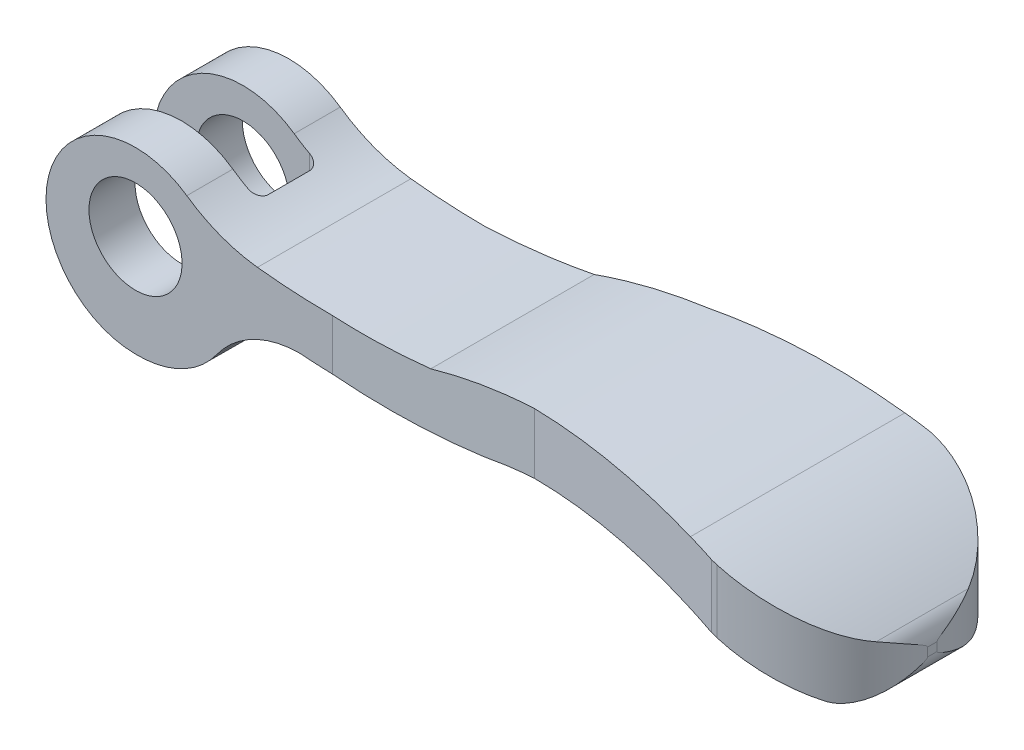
ISO-10303-21;
HEADER;
FILE_DESCRIPTION(('STEP AP214'),'2;1');
FILE_NAME('part.step','',(''),(''),'','','');
FILE_SCHEMA(('AUTOMOTIVE_DESIGN { 1 0 10303 214 1 1 1 1 }'));
ENDSEC;
DATA;
#1=APPLICATION_CONTEXT('core data for automotive mechanical design processes');
#2=APPLICATION_PROTOCOL_DEFINITION('international standard','automotive_design',2000,#1);
#3=PRODUCT_CONTEXT('',#1,'mechanical');
#4=PRODUCT('Part','Part','',(#3));
#5=PRODUCT_RELATED_PRODUCT_CATEGORY('part','',(#4));
#6=PRODUCT_DEFINITION_FORMATION('','',#4);
#7=PRODUCT_DEFINITION_CONTEXT('part definition',#1,'design');
#8=PRODUCT_DEFINITION('design','',#6,#7);
#9=PRODUCT_DEFINITION_SHAPE('','',#8);
#10=(LENGTH_UNIT() NAMED_UNIT(*) SI_UNIT(.MILLI.,.METRE.));
#11=(NAMED_UNIT(*) PLANE_ANGLE_UNIT() SI_UNIT($,.RADIAN.));
#12=(NAMED_UNIT(*) SI_UNIT($,.STERADIAN.) SOLID_ANGLE_UNIT());
#13=UNCERTAINTY_MEASURE_WITH_UNIT(LENGTH_MEASURE(1.E-05),#10,'distance_accuracy_value','');
#14=(GEOMETRIC_REPRESENTATION_CONTEXT(3) GLOBAL_UNCERTAINTY_ASSIGNED_CONTEXT((#13)) GLOBAL_UNIT_ASSIGNED_CONTEXT((#10,
#11,#12)) REPRESENTATION_CONTEXT('',''));
#15=CARTESIAN_POINT('',(0.,0.,0.));
#16=DIRECTION('',(0.,0.,1.));
#17=DIRECTION('',(1.,0.,0.));
#18=AXIS2_PLACEMENT_3D('',#15,#16,#17);
#19=CARTESIAN_POINT('',(0.,-1.2,10.75));
#20=DIRECTION('',(0.,0.,-1.));
#21=DIRECTION('',(-1.,0.,0.));
#22=AXIS2_PLACEMENT_3D('',#19,#20,#21);
#23=CYLINDRICAL_SURFACE('',#22,8.75);
#24=DIRECTION('',(0.,0.,-1.));
#25=VECTOR('',#24,1.);
#26=CARTESIAN_POINT('',(-1.13913346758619E-13,-9.95,10.75));
#27=LINE('',#26,#25);
#28=CARTESIAN_POINT('',(-1.13913346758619E-13,-9.95,7.5));
#29=VERTEX_POINT('',#28);
#30=CARTESIAN_POINT('',(-1.13913346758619E-13,-9.95,3.));
#31=VERTEX_POINT('',#30);
#32=EDGE_CURVE('E234',#29,#31,#27,.T.);
#33=ORIENTED_EDGE('',*,*,#32,.F.);
#34=CARTESIAN_POINT('',(0.,-1.2,7.5));
#35=DIRECTION('',(0.,0.,-1.));
#36=DIRECTION('',(-1.,0.,0.));
#37=AXIS2_PLACEMENT_3D('',#34,#35,#36);
#38=CIRCLE('',#37,8.75);
#39=CARTESIAN_POINT('',(5.01614740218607,5.96943269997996,7.5));
#40=VERTEX_POINT('',#39);
#41=EDGE_CURVE('E270',#29,#40,#38,.T.);
#42=ORIENTED_EDGE('',*,*,#41,.T.);
#43=DIRECTION('',(0.,0.,-1.));
#44=VECTOR('',#43,1.);
#45=CARTESIAN_POINT('',(5.01614740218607,5.96943269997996,10.75));
#46=LINE('',#45,#44);
#47=CARTESIAN_POINT('',(5.01614740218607,5.96943269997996,3.));
#48=VERTEX_POINT('',#47);
#49=EDGE_CURVE('E230',#40,#48,#46,.T.);
#50=ORIENTED_EDGE('',*,*,#49,.T.);
#51=CARTESIAN_POINT('',(0.,-1.2,3.));
#52=DIRECTION('',(0.,0.,1.));
#53=DIRECTION('',(1.,0.,0.));
#54=AXIS2_PLACEMENT_3D('',#51,#52,#53);
#55=CIRCLE('',#54,8.75);
#56=EDGE_CURVE('E267',#48,#31,#55,.T.);
#57=ORIENTED_EDGE('',*,*,#56,.T.);
#58=EDGE_LOOP('',(#33,#42,#50,#57));
#59=FACE_BOUND('',#58,.T.);
#60=ADVANCED_FACE('F14',(#59),#23,.T.);
#61=CARTESIAN_POINT('',(13.6152572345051,18.2598887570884,10.75));
#62=DIRECTION('',(0.,0.,-1.));
#63=DIRECTION('',(-1.,0.,0.));
#64=AXIS2_PLACEMENT_3D('',#61,#62,#63);
#65=CYLINDRICAL_SURFACE('',#64,15.);
#66=CARTESIAN_POINT('',(13.6152572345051,18.2598887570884,-7.5));
#67=DIRECTION('',(0.,0.,1.));
#68=DIRECTION('',(1.,0.,0.));
#69=AXIS2_PLACEMENT_3D('',#66,#67,#68);
#70=CIRCLE('',#69,15.);
#71=CARTESIAN_POINT('',(5.01614740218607,5.96943269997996,-7.5));
#72=VERTEX_POINT('',#71);
#73=CARTESIAN_POINT('',(11.9235711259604,3.3555874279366,-7.5));
#74=VERTEX_POINT('',#73);
#75=EDGE_CURVE('E417',#72,#74,#70,.T.);
#76=ORIENTED_EDGE('',*,*,#75,.F.);
#77=CARTESIAN_POINT('',(5.01614740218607,5.96943269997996,-3.));
#78=VERTEX_POINT('',#77);
#79=EDGE_CURVE('E227',#78,#72,#46,.T.);
#80=ORIENTED_EDGE('',*,*,#79,.F.);
#81=CARTESIAN_POINT('',(13.6152572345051,18.2598887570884,-3.));
#82=DIRECTION('',(0.,0.,-1.));
#83=DIRECTION('',(-1.,0.,0.));
#84=AXIS2_PLACEMENT_3D('',#81,#82,#83);
#85=CIRCLE('',#84,15.);
#86=CARTESIAN_POINT('',(6.5,5.05484750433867,-3.));
#87=VERTEX_POINT('',#86);
#88=EDGE_CURVE('E31',#87,#78,#85,.T.);
#89=ORIENTED_EDGE('',*,*,#88,.F.);
#90=CARTESIAN_POINT('',(6.5,5.05484750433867,-3.));
#91=CARTESIAN_POINT('',(6.56059510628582,5.02217540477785,-3.00002652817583));
#92=CARTESIAN_POINT('',(6.62149698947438,4.98991920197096,-2.99448964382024));
#93=CARTESIAN_POINT('',(6.74233896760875,4.92694069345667,-2.97213776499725));
#94=CARTESIAN_POINT('',(6.80227382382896,4.89622555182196,-2.95527455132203));
#95=CARTESIAN_POINT('',(6.91921265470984,4.83724645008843,-2.91005579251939));
#96=CARTESIAN_POINT('',(6.9762083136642,4.80898930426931,-2.88166946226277));
#97=CARTESIAN_POINT('',(7.08478773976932,4.75594106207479,-2.81370289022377));
#98=CARTESIAN_POINT('',(7.13638160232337,4.73114347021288,-2.77414405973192));
#99=CARTESIAN_POINT('',(7.22777410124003,4.68777003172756,-2.68842560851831));
#100=CARTESIAN_POINT('',(7.26820368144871,4.6688437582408,-2.64311781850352));
#101=CARTESIAN_POINT('',(7.3407457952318,4.63520122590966,-2.54485591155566));
#102=CARTESIAN_POINT('',(7.37285929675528,4.62048447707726,-2.49190268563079));
#103=CARTESIAN_POINT('',(7.42418452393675,4.59711699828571,-2.38597810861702));
#104=CARTESIAN_POINT('',(7.44439789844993,4.58799109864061,-2.3335943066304));
#105=CARTESIAN_POINT('',(7.47580348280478,4.57385901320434,-2.2257148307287));
#106=CARTESIAN_POINT('',(7.48701466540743,4.56884416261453,-2.17022596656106));
#107=CARTESIAN_POINT('',(7.49564077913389,4.56498835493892,-2.09521774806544));
#108=CARTESIAN_POINT('',(7.49727562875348,4.56425799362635,-2.07620303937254));
#109=CARTESIAN_POINT('',(7.49945376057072,4.56328517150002,-2.03812871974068));
#110=CARTESIAN_POINT('',(7.49999875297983,4.56304194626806,-2.01906922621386));
#111=CARTESIAN_POINT('',(7.5,4.56304134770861,-2.));
#112=B_SPLINE_CURVE_WITH_KNOTS('',3,(#90,#91,#92,#93,#94,#95,#96,#97,#98,#99,#100,#101,#102,
#103,#104,#105,#106,#107,#108,#109,#110,#111),.UNSPECIFIED.,.F.,.F.,(4,2,2,2,2,2,2,2,2,2,4),(0.,
0.20641748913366,0.413719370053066,0.621578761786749,0.829042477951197,1.01879478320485,
1.20852499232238,1.37830226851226,1.54772078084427,1.60498966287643,1.66216860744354),.UNSPECIFIED.);
#113=CARTESIAN_POINT('',(7.5,4.56304134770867,-2.));
#114=VERTEX_POINT('',#113);
#115=EDGE_CURVE('E303',#87,#114,#112,.T.);
#116=ORIENTED_EDGE('',*,*,#115,.T.);
#117=DIRECTION('',(0.,0.,-1.));
#118=VECTOR('',#117,1.);
#119=CARTESIAN_POINT('',(7.5,4.56304134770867,10.75));
#120=LINE('',#119,#118);
#121=CARTESIAN_POINT('',(7.5,4.56304134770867,2.));
#122=VERTEX_POINT('',#121);
#123=EDGE_CURVE('E311',#122,#114,#120,.T.);
#124=ORIENTED_EDGE('',*,*,#123,.F.);
#125=CARTESIAN_POINT('',(7.5,4.56304134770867,2.));
#126=CARTESIAN_POINT('',(7.50000095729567,4.56304138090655,2.02628734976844));
#127=CARTESIAN_POINT('',(7.49896271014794,4.56350442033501,2.0525615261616));
#128=CARTESIAN_POINT('',(7.49482835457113,4.56535123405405,2.10490970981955));
#129=CARTESIAN_POINT('',(7.49173265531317,4.56673482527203,2.13098375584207));
#130=CARTESIAN_POINT('',(7.47942026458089,4.57224505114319,2.20846757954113));
#131=CARTESIAN_POINT('',(7.46717792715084,4.57773124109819,2.25933766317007));
#132=CARTESIAN_POINT('',(7.43514036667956,4.59217279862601,2.35806423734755));
#133=CARTESIAN_POINT('',(7.41534698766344,4.60112731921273,2.40592146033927));
#134=CARTESIAN_POINT('',(7.36899294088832,4.62226326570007,2.49747824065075));
#135=CARTESIAN_POINT('',(7.34242945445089,4.63444603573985,2.54117605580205));
#136=CARTESIAN_POINT('',(7.2825927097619,4.6621508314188,2.62471651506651));
#137=CARTESIAN_POINT('',(7.24913653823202,4.67776488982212,2.66439708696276));
#138=CARTESIAN_POINT('',(7.1772253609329,4.71170343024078,2.73756287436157));
#139=CARTESIAN_POINT('',(7.13876963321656,4.73002830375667,2.77104719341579));
#140=CARTESIAN_POINT('',(7.05471223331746,4.77057465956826,2.833825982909));
#141=CARTESIAN_POINT('',(7.0087834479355,4.79299215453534,2.86255489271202));
#142=CARTESIAN_POINT('',(6.91377794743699,4.84001565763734,2.91195362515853));
#143=CARTESIAN_POINT('',(6.86469806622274,4.86462387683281,2.93261518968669));
#144=CARTESIAN_POINT('',(6.76333652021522,4.91618316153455,2.96621986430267));
#145=CARTESIAN_POINT('',(6.71100412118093,4.94317966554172,2.97893845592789));
#146=CARTESIAN_POINT('',(6.60570737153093,4.99829680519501,2.99582578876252));
#147=CARTESIAN_POINT('',(6.55274475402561,5.02641470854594,3.00001415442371));
#148=CARTESIAN_POINT('',(6.5,5.05484750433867,3.));
#149=B_SPLINE_CURVE_WITH_KNOTS('',3,(#125,#126,#127,#128,#129,#130,#131,#132,#133,#134,#135,
#136,#137,#138,#139,#140,#141,#142,#143,#144,#145,#146,#147,#148),.UNSPECIFIED.,.F.,.F.,(4,2,2,
2,2,2,2,2,2,2,2,4),(0.,0.0788116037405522,0.157607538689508,0.314611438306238,0.471577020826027,
0.628608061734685,0.790520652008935,0.952456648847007,1.1276185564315,1.30295930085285,
1.48305523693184,1.66273637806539),.UNSPECIFIED.);
#150=CARTESIAN_POINT('',(6.5,5.05484750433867,3.));
#151=VERTEX_POINT('',#150);
#152=EDGE_CURVE('E315',#122,#151,#149,.T.);
#153=ORIENTED_EDGE('',*,*,#152,.T.);
#154=CARTESIAN_POINT('',(13.6152572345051,18.2598887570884,3.));
#155=DIRECTION('',(0.,0.,1.));
#156=DIRECTION('',(1.,0.,0.));
#157=AXIS2_PLACEMENT_3D('',#154,#155,#156);
#158=CIRCLE('',#157,15.);
#159=EDGE_CURVE('E398',#48,#151,#158,.T.);
#160=ORIENTED_EDGE('',*,*,#159,.F.);
#161=ORIENTED_EDGE('',*,*,#49,.F.);
#162=CARTESIAN_POINT('',(13.6152572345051,18.2598887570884,7.5));
#163=DIRECTION('',(0.,0.,-1.));
#164=DIRECTION('',(-1.,0.,0.));
#165=AXIS2_PLACEMENT_3D('',#162,#163,#164);
#166=CIRCLE('',#165,15.);
#167=CARTESIAN_POINT('',(11.9235711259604,3.3555874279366,7.5));
#168=VERTEX_POINT('',#167);
#169=EDGE_CURVE('E406',#168,#40,#166,.T.);
#170=ORIENTED_EDGE('',*,*,#169,.F.);
#171=DIRECTION('',(0.,0.,-1.));
#172=VECTOR('',#171,1.);
#173=CARTESIAN_POINT('',(11.9235711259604,3.35558742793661,10.75));
#174=LINE('',#173,#172);
#175=EDGE_CURVE('E201',#168,#74,#174,.T.);
#176=ORIENTED_EDGE('',*,*,#175,.T.);
#177=EDGE_LOOP('',(#76,#80,#89,#116,#124,#153,#160,#161,#170,#176));
#178=FACE_BOUND('',#177,.T.);
#179=ADVANCED_FACE('F16',(#178),#65,.F.);
#180=CARTESIAN_POINT('',(19.27,68.0800000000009,10.75));
#181=DIRECTION('',(0.,0.,-1.));
#182=DIRECTION('',(-1.,0.,0.));
#183=AXIS2_PLACEMENT_3D('',#180,#181,#182);
#184=CYLINDRICAL_SURFACE('',#183,65.1400000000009);
#185=CARTESIAN_POINT('',(19.27,68.0800000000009,-7.5));
#186=DIRECTION('',(0.,0.,1.));
#187=DIRECTION('',(1.,0.,0.));
#188=AXIS2_PLACEMENT_3D('',#185,#186,#187);
#189=CIRCLE('',#188,65.1400000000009);
#190=CARTESIAN_POINT('',(19.27,2.94,-7.5));
#191=VERTEX_POINT('',#190);
#192=EDGE_CURVE('E312',#74,#191,#189,.T.);
#193=ORIENTED_EDGE('',*,*,#192,.F.);
#194=ORIENTED_EDGE('',*,*,#175,.F.);
#195=CARTESIAN_POINT('',(19.27,68.0800000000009,7.5));
#196=DIRECTION('',(0.,0.,-1.));
#197=DIRECTION('',(-1.,0.,0.));
#198=AXIS2_PLACEMENT_3D('',#195,#196,#197);
#199=CIRCLE('',#198,65.1400000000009);
#200=CARTESIAN_POINT('',(19.27,2.94,7.5));
#201=VERTEX_POINT('',#200);
#202=EDGE_CURVE('E408',#201,#168,#199,.T.);
#203=ORIENTED_EDGE('',*,*,#202,.F.);
#204=CARTESIAN_POINT('',(19.27,68.0800000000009,7.5));
#205=DIRECTION('',(0.048183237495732,0.,-0.998838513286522));
#206=DIRECTION('',(-0.998838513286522,0.,-0.048183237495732));
#207=AXIS2_PLACEMENT_3D('',#204,#205,#206);
#208=ELLIPSE('',#207,65.215747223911,65.1400000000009);
#209=CARTESIAN_POINT('',(29.3546847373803,3.72536742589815,7.98647779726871));
#210=VERTEX_POINT('',#209);
#211=EDGE_CURVE('E361',#210,#201,#208,.T.);
#212=ORIENTED_EDGE('',*,*,#211,.F.);
#213=DIRECTION('',(0.,0.,-1.));
#214=VECTOR('',#213,1.);
#215=CARTESIAN_POINT('',(29.3546847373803,3.72536742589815,10.75));
#216=LINE('',#215,#214);
#217=CARTESIAN_POINT('',(29.3546847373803,3.72536742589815,-7.98647779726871));
#218=VERTEX_POINT('',#217);
#219=EDGE_CURVE('E257',#210,#218,#216,.T.);
#220=ORIENTED_EDGE('',*,*,#219,.T.);
#221=CARTESIAN_POINT('',(19.27,68.0800000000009,-7.5));
#222=DIRECTION('',(0.048183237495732,0.,0.998838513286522));
#223=DIRECTION('',(0.998838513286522,0.,-0.048183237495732));
#224=AXIS2_PLACEMENT_3D('',#221,#222,#223);
#225=ELLIPSE('',#224,65.215747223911,65.1400000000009);
#226=EDGE_CURVE('E217',#191,#218,#225,.T.);
#227=ORIENTED_EDGE('',*,*,#226,.F.);
#228=EDGE_LOOP('',(#193,#194,#203,#212,#220,#227));
#229=FACE_BOUND('',#228,.T.);
#230=ADVANCED_FACE('F432',(#229),#184,.F.);
#231=CARTESIAN_POINT('',(45.,-44.7,10.75));
#232=DIRECTION('',(0.,0.,-1.));
#233=DIRECTION('',(-1.,0.,0.));
#234=AXIS2_PLACEMENT_3D('',#231,#232,#233);
#235=CYLINDRICAL_SURFACE('',#234,50.89);
#236=CARTESIAN_POINT('',(45.,-44.7,-9.07506361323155));
#237=DIRECTION('',(0.11425949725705,0.,0.993450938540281));
#238=DIRECTION('',(0.993450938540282,0.,-0.11425949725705));
#239=AXIS2_PLACEMENT_3D('',#236,#237,#238);
#240=ELLIPSE('',#239,51.2254788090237,50.89);
#241=CARTESIAN_POINT('',(57.2341132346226,4.69755635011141,-10.4821422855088));
#242=VERTEX_POINT('',#241);
#243=CARTESIAN_POINT('',(40.,5.94377651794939,-8.5));
#244=VERTEX_POINT('',#243);
#245=EDGE_CURVE('E388',#242,#244,#240,.T.);
#246=ORIENTED_EDGE('',*,*,#245,.T.);
#247=CARTESIAN_POINT('',(45.,-44.7,-8.74119633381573));
#248=DIRECTION('',(0.048183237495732,0.,0.998838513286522));
#249=DIRECTION('',(0.998838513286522,0.,-0.048183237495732));
#250=AXIS2_PLACEMENT_3D('',#247,#248,#249);
#251=ELLIPSE('',#250,50.9491767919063,50.89);
#252=EDGE_CURVE('E221',#244,#218,#251,.T.);
#253=ORIENTED_EDGE('',*,*,#252,.T.);
#254=ORIENTED_EDGE('',*,*,#219,.F.);
#255=CARTESIAN_POINT('',(45.,-44.7,8.74119633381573));
#256=DIRECTION('',(0.048183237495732,0.,-0.998838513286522));
#257=DIRECTION('',(-0.998838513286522,0.,-0.048183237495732));
#258=AXIS2_PLACEMENT_3D('',#255,#256,#257);
#259=ELLIPSE('',#258,50.9491767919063,50.89);
#260=CARTESIAN_POINT('',(40.,5.94377651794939,8.5));
#261=VERTEX_POINT('',#260);
#262=EDGE_CURVE('E359',#210,#261,#259,.T.);
#263=ORIENTED_EDGE('',*,*,#262,.T.);
#264=CARTESIAN_POINT('',(45.,-44.7,9.07506361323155));
#265=DIRECTION('',(0.11425949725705,0.,-0.993450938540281));
#266=DIRECTION('',(-0.993450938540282,0.,-0.11425949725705));
#267=AXIS2_PLACEMENT_3D('',#264,#265,#266);
#268=ELLIPSE('',#267,51.2254788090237,50.89);
#269=CARTESIAN_POINT('',(57.2341132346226,4.69755635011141,10.4821422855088));
#270=VERTEX_POINT('',#269);
#271=EDGE_CURVE('E384',#261,#270,#268,.T.);
#272=ORIENTED_EDGE('',*,*,#271,.T.);
#273=DIRECTION('',(0.,0.,-1.));
#274=VECTOR('',#273,1.);
#275=CARTESIAN_POINT('',(57.2341132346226,4.69755635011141,10.75));
#276=LINE('',#275,#274);
#277=EDGE_CURVE('E254',#270,#242,#276,.T.);
#278=ORIENTED_EDGE('',*,*,#277,.T.);
#279=EDGE_LOOP('',(#246,#253,#254,#263,#272,#278));
#280=FACE_BOUND('',#279,.T.);
#281=ADVANCED_FACE('F436',(#280),#235,.T.);
#282=CARTESIAN_POINT('',(49.78,-26.71,10.75));
#283=DIRECTION('',(0.,0.,-1.));
#284=DIRECTION('',(-1.,0.,0.));
#285=AXIS2_PLACEMENT_3D('',#282,#283,#284);
#286=CYLINDRICAL_SURFACE('',#285,32.28);
#287=CARTESIAN_POINT('',(49.78,-26.71,-10.75));
#288=DIRECTION('',(0.,0.,1.));
#289=DIRECTION('',(1.,0.,0.));
#290=AXIS2_PLACEMENT_3D('',#287,#288,#289);
#291=CIRCLE('',#290,32.28);
#292=CARTESIAN_POINT('',(60.113788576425,3.8712232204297,-10.75));
#293=VERTEX_POINT('',#292);
#294=CARTESIAN_POINT('',(59.5630530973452,4.05183141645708,-10.75));
#295=VERTEX_POINT('',#294);
#296=EDGE_CURVE('E208',#293,#295,#291,.T.);
#297=ORIENTED_EDGE('',*,*,#296,.T.);
#298=CARTESIAN_POINT('',(49.78,-26.71,-9.62482442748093));
#299=DIRECTION('',(0.11425949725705,0.,0.993450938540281));
#300=DIRECTION('',(0.993450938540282,0.,-0.11425949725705));
#301=AXIS2_PLACEMENT_3D('',#298,#299,#300);
#302=ELLIPSE('',#301,32.4927973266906,32.28);
#303=EDGE_CURVE('E817',#295,#242,#302,.T.);
#304=ORIENTED_EDGE('',*,*,#303,.T.);
#305=ORIENTED_EDGE('',*,*,#277,.F.);
#306=CARTESIAN_POINT('',(49.78,-26.71,9.62482442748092));
#307=DIRECTION('',(0.11425949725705,0.,-0.993450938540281));
#308=DIRECTION('',(-0.993450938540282,0.,-0.11425949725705));
#309=AXIS2_PLACEMENT_3D('',#306,#307,#308);
#310=ELLIPSE('',#309,32.4927973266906,32.28);
#311=CARTESIAN_POINT('',(59.5630530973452,4.05183141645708,10.75));
#312=VERTEX_POINT('',#311);
#313=EDGE_CURVE('E382',#270,#312,#310,.T.);
#314=ORIENTED_EDGE('',*,*,#313,.T.);
#315=CARTESIAN_POINT('',(49.78,-26.71,10.75));
#316=DIRECTION('',(0.,0.,1.));
#317=DIRECTION('',(1.,0.,0.));
#318=AXIS2_PLACEMENT_3D('',#315,#316,#317);
#319=CIRCLE('',#318,32.28);
#320=CARTESIAN_POINT('',(60.1137885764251,3.87122322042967,10.75));
#321=VERTEX_POINT('',#320);
#322=EDGE_CURVE('E219',#321,#312,#319,.T.);
#323=ORIENTED_EDGE('',*,*,#322,.F.);
#324=CARTESIAN_POINT('',(60.1137885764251,3.87122322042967,10.75));
#325=CARTESIAN_POINT('',(60.2764299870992,3.81626657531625,10.7429828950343));
#326=CARTESIAN_POINT('',(60.4384635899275,3.76006529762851,10.7322942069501));
#327=CARTESIAN_POINT('',(60.7610381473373,3.64530411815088,10.7037103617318));
#328=CARTESIAN_POINT('',(60.9215792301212,3.58674442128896,10.685815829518));
#329=CARTESIAN_POINT('',(61.4003110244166,3.40781341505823,10.6215631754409));
#330=CARTESIAN_POINT('',(61.7158957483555,3.28409359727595,10.5646232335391));
#331=CARTESIAN_POINT('',(62.3370682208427,3.02938375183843,10.4239386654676));
#332=CARTESIAN_POINT('',(62.6426770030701,2.8984108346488,10.340255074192));
#333=CARTESIAN_POINT('',(63.2429822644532,2.63032336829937,10.1472896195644));
#334=CARTESIAN_POINT('',(63.5376768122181,2.49320774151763,10.0380032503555));
#335=CARTESIAN_POINT('',(64.1138124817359,2.21477028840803,9.79537824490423));
#336=CARTESIAN_POINT('',(64.39528627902,2.0734604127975,9.66210332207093));
#337=CARTESIAN_POINT('',(64.9444808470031,1.78794206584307,9.37243027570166));
#338=CARTESIAN_POINT('',(65.2122027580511,1.64373383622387,9.21603407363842));
#339=CARTESIAN_POINT('',(65.7328600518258,1.35409519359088,8.88100724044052));
#340=CARTESIAN_POINT('',(65.985788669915,1.20866425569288,8.70236655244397));
#341=CARTESIAN_POINT('',(66.4755932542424,0.918546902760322,8.32374330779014));
#342=CARTESIAN_POINT('',(66.7124687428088,0.773860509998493,8.12376011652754));
#343=CARTESIAN_POINT('',(67.1953696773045,0.470758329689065,7.67885768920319));
#344=CARTESIAN_POINT('',(67.4392960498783,0.312685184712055,7.43141605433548));
#345=CARTESIAN_POINT('',(67.9038572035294,0.00333200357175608,6.91179219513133));
#346=CARTESIAN_POINT('',(68.1244984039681,-0.147949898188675,6.63961682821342));
#347=CARTESIAN_POINT('',(68.5409745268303,-0.440454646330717,6.0706443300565));
#348=CARTESIAN_POINT('',(68.7367527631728,-0.581654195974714,5.77379340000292));
#349=CARTESIAN_POINT('',(69.1005433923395,-0.849479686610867,5.15685336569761));
#350=CARTESIAN_POINT('',(69.268520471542,-0.976087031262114,4.83673543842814));
#351=CARTESIAN_POINT('',(69.4211551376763,-1.09314178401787,4.50578783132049));
#352=B_SPLINE_CURVE_WITH_KNOTS('',3,(#324,#325,#326,#327,#328,#329,#330,#331,#332,#333,#334,
#335,#336,#337,#338,#339,#340,#341,#342,#343,#344,#345,#346,#347,#348,#349,#350,#351),
.UNSPECIFIED.,.F.,.F.,(4,2,2,2,2,2,2,2,2,2,2,2,2,4),(0.,0.515360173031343,1.030675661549,
2.06040499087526,3.08780083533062,4.11537762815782,5.14026441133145,6.16506607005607,
7.19033274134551,8.21562990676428,9.35925694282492,10.5025678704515,11.648440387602,
12.7957574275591),.UNSPECIFIED.);
#353=CARTESIAN_POINT('',(69.4211551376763,-1.09314178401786,4.5057878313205));
#354=VERTEX_POINT('',#353);
#355=EDGE_CURVE('E39',#321,#354,#352,.T.);
#356=ORIENTED_EDGE('',*,*,#355,.T.);
#357=DIRECTION('',(0.,0.,-1.));
#358=VECTOR('',#357,1.);
#359=CARTESIAN_POINT('',(69.4211551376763,-1.09314178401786,10.75));
#360=LINE('',#359,#358);
#361=CARTESIAN_POINT('',(69.4211551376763,-1.09314178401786,-4.5057878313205));
#362=VERTEX_POINT('',#361);
#363=EDGE_CURVE('E210',#354,#362,#360,.T.);
#364=ORIENTED_EDGE('',*,*,#363,.T.);
#365=CARTESIAN_POINT('',(69.4211551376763,-1.09314178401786,-4.5057878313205));
#366=CARTESIAN_POINT('',(69.2856522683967,-0.989233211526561,-4.79960968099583));
#367=CARTESIAN_POINT('',(69.1380279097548,-0.877763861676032,-5.08492545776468));
#368=CARTESIAN_POINT('',(68.8205814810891,-0.642906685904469,-5.63732631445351));
#369=CARTESIAN_POINT('',(68.6507832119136,-0.51953167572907,-5.90443048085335));
#370=CARTESIAN_POINT('',(68.2911075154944,-0.264094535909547,-6.4192897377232));
#371=CARTESIAN_POINT('',(68.1012720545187,-0.132050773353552,-6.66708345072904));
#372=CARTESIAN_POINT('',(67.7027012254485,0.138336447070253,-7.14339282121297));
#373=CARTESIAN_POINT('',(67.4939601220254,0.276681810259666,-7.37190258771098));
#374=CARTESIAN_POINT('',(67.0598819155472,0.556655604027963,-7.80804123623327));
#375=CARTESIAN_POINT('',(66.8346188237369,0.698267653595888,-8.01575443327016));
#376=CARTESIAN_POINT('',(66.3678832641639,0.983235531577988,-8.41077369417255));
#377=CARTESIAN_POINT('',(66.126410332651,1.1265914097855,-8.5980791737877));
#378=CARTESIAN_POINT('',(65.6282762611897,1.41317766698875,-8.95159812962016));
#379=CARTESIAN_POINT('',(65.3716104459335,1.55640799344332,-9.11780506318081));
#380=CARTESIAN_POINT('',(64.8442290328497,1.84095824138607,-9.42821448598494));
#381=CARTESIAN_POINT('',(64.5735109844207,1.98227782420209,-9.57241311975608));
#382=CARTESIAN_POINT('',(63.9764667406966,2.28287671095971,-9.85824667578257));
#383=CARTESIAN_POINT('',(63.6480009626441,2.4415668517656,-9.99606068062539));
#384=CARTESIAN_POINT('',(62.9760860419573,2.75181723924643,-10.2392585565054));
#385=CARTESIAN_POINT('',(62.6326384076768,2.90337820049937,-10.3446456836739));
#386=CARTESIAN_POINT('',(61.9320825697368,3.19768974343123,-10.5214298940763));
#387=CARTESIAN_POINT('',(61.5749379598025,3.34041376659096,-10.5927284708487));
#388=CARTESIAN_POINT('',(61.0319897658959,3.54605264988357,-10.6724526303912));
#389=CARTESIAN_POINT('',(60.8497028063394,3.61322460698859,-10.694494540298));
#390=CARTESIAN_POINT('',(60.4831378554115,3.74454278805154,-10.7292763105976));
#391=CARTESIAN_POINT('',(60.2988596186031,3.80868863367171,-10.74201501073));
#392=CARTESIAN_POINT('',(60.113788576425,3.8712232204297,-10.75));
#393=B_SPLINE_CURVE_WITH_KNOTS('',3,(#365,#366,#367,#368,#369,#370,#371,#372,#373,#374,#375,
#376,#377,#378,#379,#380,#381,#382,#383,#384,#385,#386,#387,#388,#389,#390,#391,#392),
.UNSPECIFIED.,.F.,.F.,(4,2,2,2,2,2,2,2,2,2,2,2,2,4),(0.,1.01880479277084,2.03652488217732,
3.05215421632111,4.0680926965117,5.07972959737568,6.09139545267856,7.10337426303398,
8.1155301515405,9.28369353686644,10.4517395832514,11.6231408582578,12.2094663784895,
12.7958650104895),.UNSPECIFIED.);
#394=EDGE_CURVE('E192',#362,#293,#393,.T.);
#395=ORIENTED_EDGE('',*,*,#394,.T.);
#396=EDGE_LOOP('',(#297,#304,#305,#314,#323,#356,#364,#395));
#397=FACE_BOUND('',#396,.T.);
#398=ADVANCED_FACE('F206',(#397),#286,.T.);
#399=CARTESIAN_POINT('',(67.9,-3.07709920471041,10.75));
#400=DIRECTION('',(0.,0.,-1.));
#401=DIRECTION('',(-1.,0.,0.));
#402=AXIS2_PLACEMENT_3D('',#399,#400,#401);
#403=CYLINDRICAL_SURFACE('',#402,2.5);
#404=DIRECTION('',(0.,0.,-1.));
#405=VECTOR('',#404,1.);
#406=CARTESIAN_POINT('',(70.4,-3.07709920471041,10.75));
#407=LINE('',#406,#405);
#408=CARTESIAN_POINT('',(70.4,-3.0770992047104,0.463784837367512));
#409=VERTEX_POINT('',#408);
#410=CARTESIAN_POINT('',(70.4,-3.0770992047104,-0.46378483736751));
#411=VERTEX_POINT('',#410);
#412=EDGE_CURVE('E250',#409,#411,#407,.T.);
#413=ORIENTED_EDGE('',*,*,#412,.T.);
#414=CARTESIAN_POINT('',(70.4,-3.0770992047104,-0.463784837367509));
#415=CARTESIAN_POINT('',(70.4000012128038,-3.06943656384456,-0.463751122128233));
#416=CARTESIAN_POINT('',(70.3999648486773,-3.06183217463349,-0.464600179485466));
#417=CARTESIAN_POINT('',(70.3998300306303,-3.04707538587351,-0.467711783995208));
#418=CARTESIAN_POINT('',(70.3997328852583,-3.03991687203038,-0.469944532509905));
#419=CARTESIAN_POINT('',(70.3994429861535,-3.02346248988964,-0.476534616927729));
#420=CARTESIAN_POINT('',(70.399228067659,-3.01436793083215,-0.481374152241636));
#421=CARTESIAN_POINT('',(70.3987297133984,-2.99693886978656,-0.492379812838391));
#422=CARTESIAN_POINT('',(70.3984456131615,-2.98861288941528,-0.498558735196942));
#423=CARTESIAN_POINT('',(70.3972001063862,-2.95628611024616,-0.525043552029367));
#424=CARTESIAN_POINT('',(70.3960390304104,-2.93494759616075,-0.548460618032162));
#425=CARTESIAN_POINT('',(70.3934328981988,-2.89495210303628,-0.59739370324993));
#426=CARTESIAN_POINT('',(70.3919861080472,-2.87631276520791,-0.622921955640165));
#427=CARTESIAN_POINT('',(70.3867126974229,-2.81615976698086,-0.710145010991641));
#428=CARTESIAN_POINT('',(70.3823155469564,-2.7778341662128,-0.774022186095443));
#429=CARTESIAN_POINT('',(70.3722305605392,-2.70370336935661,-0.903129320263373));
#430=CARTESIAN_POINT('',(70.366540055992,-2.66790358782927,-0.968361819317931));
#431=CARTESIAN_POINT('',(70.3538939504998,-2.5978528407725,-1.09934044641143));
#432=CARTESIAN_POINT('',(70.3469417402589,-2.56359802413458,-1.1650847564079));
#433=CARTESIAN_POINT('',(70.3317730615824,-2.49600370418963,-1.29681268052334));
#434=CARTESIAN_POINT('',(70.3235576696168,-2.46266344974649,-1.36279604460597));
#435=CARTESIAN_POINT('',(70.2974630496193,-2.36533002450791,-1.55755330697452));
#436=CARTESIAN_POINT('',(70.277805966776,-2.30224231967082,-1.68655041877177));
#437=CARTESIAN_POINT('',(70.233631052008,-2.17793063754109,-1.94460990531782));
#438=CARTESIAN_POINT('',(70.2091126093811,-2.1167068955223,-2.07367228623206));
#439=CARTESIAN_POINT('',(70.1281475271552,-1.935665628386,-2.46080171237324));
#440=CARTESIAN_POINT('',(70.0643106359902,-1.81855081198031,-2.71866392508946));
#441=CARTESIAN_POINT('',(69.9533214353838,-1.64936452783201,-3.10437763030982));
#442=CARTESIAN_POINT('',(69.9137031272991,-1.59395865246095,-3.23299352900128));
#443=CARTESIAN_POINT('',(69.8293104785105,-1.48572455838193,-3.48962358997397));
#444=CARTESIAN_POINT('',(69.7845363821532,-1.43289621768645,-3.61763778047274));
#445=CARTESIAN_POINT('',(69.6897705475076,-1.33021555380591,-3.87287130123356));
#446=CARTESIAN_POINT('',(69.6397806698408,-1.28036217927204,-4.00009089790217));
#447=CARTESIAN_POINT('',(69.5344786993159,-1.18407015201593,-4.25364771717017));
#448=CARTESIAN_POINT('',(69.4791655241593,-1.13763219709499,-4.37998475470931));
#449=CARTESIAN_POINT('',(69.4211551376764,-1.09314178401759,-4.50578783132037));
#450=B_SPLINE_CURVE_WITH_KNOTS('',3,(#414,#415,#416,#417,#418,#419,#420,#421,#422,#423,#424,
#425,#426,#427,#428,#429,#430,#431,#432,#433,#434,#435,#436,#437,#438,#439,#440,#441,#442,#443,
#444,#445,#446,#447,#448,#449),.UNSPECIFIED.,.F.,.F.,(4,2,2,2,2,2,2,2,2,2,2,2,2,2,2,2,2,4),(0.,
0.0228483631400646,0.0452209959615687,0.0759566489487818,0.107000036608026,0.20135413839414,
0.296299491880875,0.519759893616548,0.743685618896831,0.967018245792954,1.19016159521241,
1.62485450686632,2.05960206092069,2.92959194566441,3.36612067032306,3.80262871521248,
4.23898157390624,4.67542333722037),.UNSPECIFIED.);
#451=EDGE_CURVE('E212',#411,#362,#450,.T.);
#452=ORIENTED_EDGE('',*,*,#451,.T.);
#453=ORIENTED_EDGE('',*,*,#363,.F.);
#454=CARTESIAN_POINT('',(69.4211551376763,-1.09314178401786,4.5057878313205));
#455=CARTESIAN_POINT('',(69.4817340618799,-1.139603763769,4.37441403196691));
#456=CARTESIAN_POINT('',(69.5393715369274,-1.18818726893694,4.24245885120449));
#457=CARTESIAN_POINT('',(69.6488434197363,-1.28905595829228,3.97759543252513));
#458=CARTESIAN_POINT('',(69.700679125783,-1.34134031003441,3.84468741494));
#459=CARTESIAN_POINT('',(69.798657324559,-1.44909386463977,3.57806095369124));
#460=CARTESIAN_POINT('',(69.8447994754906,-1.50456325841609,3.44434246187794));
#461=CARTESIAN_POINT('',(69.9314764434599,-1.618260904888,3.17627009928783));
#462=CARTESIAN_POINT('',(69.9720109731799,-1.6764892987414,3.04191619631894));
#463=CARTESIAN_POINT('',(70.0850017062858,-1.85420924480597,2.63927826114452));
#464=CARTESIAN_POINT('',(70.1492911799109,-1.97723550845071,2.37019652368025));
#465=CARTESIAN_POINT('',(70.2296971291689,-2.16757348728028,1.96633015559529));
#466=CARTESIAN_POINT('',(70.2538255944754,-2.23197697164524,1.83168530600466));
#467=CARTESIAN_POINT('',(70.2968059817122,-2.36289478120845,1.56258093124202));
#468=CARTESIAN_POINT('',(70.3156586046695,-2.42940882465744,1.42812138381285));
#469=CARTESIAN_POINT('',(70.3385416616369,-2.52543335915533,1.23924725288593));
#470=CARTESIAN_POINT('',(70.3447537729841,-2.55361784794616,1.18442015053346));
#471=CARTESIAN_POINT('',(70.3562974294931,-2.61078406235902,1.07509152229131));
#472=CARTESIAN_POINT('',(70.3616288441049,-2.63976590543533,1.02059004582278));
#473=CARTESIAN_POINT('',(70.3728322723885,-2.70747443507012,0.896306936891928));
#474=CARTESIAN_POINT('',(70.3784111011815,-2.74658535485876,0.826687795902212));
#475=CARTESIAN_POINT('',(70.3863596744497,-2.81492441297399,0.71426692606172));
#476=CARTESIAN_POINT('',(70.3891684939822,-2.84280299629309,0.670629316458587));
#477=CARTESIAN_POINT('',(70.3938428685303,-2.89957425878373,0.59058028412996));
#478=CARTESIAN_POINT('',(70.395778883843,-2.92800252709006,0.553907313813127));
#479=CARTESIAN_POINT('',(70.3976546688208,-2.96861825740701,0.515333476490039));
#480=CARTESIAN_POINT('',(70.3979698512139,-2.97607416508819,0.508705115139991));
#481=CARTESIAN_POINT('',(70.3985518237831,-2.99165399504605,0.496253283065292));
#482=CARTESIAN_POINT('',(70.3988185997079,-2.99977811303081,0.490430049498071));
#483=CARTESIAN_POINT('',(70.3992374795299,-3.01499692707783,0.481151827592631));
#484=CARTESIAN_POINT('',(70.399401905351,-3.02194196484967,0.477456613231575));
#485=CARTESIAN_POINT('',(70.3996775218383,-3.0363143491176,0.471210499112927));
#486=CARTESIAN_POINT('',(70.3997889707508,-3.04373915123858,0.468654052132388));
#487=CARTESIAN_POINT('',(70.3999106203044,-3.05554531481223,0.465853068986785));
#488=CARTESIAN_POINT('',(70.3999438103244,-3.05980377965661,0.465085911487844));
#489=CARTESIAN_POINT('',(70.3999886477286,-3.06840582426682,0.464047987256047));
#490=CARTESIAN_POINT('',(70.4000001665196,-3.07274975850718,0.463780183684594));
#491=CARTESIAN_POINT('',(70.4,-3.0770992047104,0.463784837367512));
#492=B_SPLINE_CURVE_WITH_KNOTS('',3,(#454,#455,#456,#457,#458,#459,#460,#461,#462,#463,#464,
#465,#466,#467,#468,#469,#470,#471,#472,#473,#474,#475,#476,#477,#478,#479,#480,#481,#482,#483,
#484,#485,#486,#487,#488,#489,#490,#491),.UNSPECIFIED.,.F.,.F.,(4,2,2,2,2,2,2,2,2,2,2,2,2,2,2,2,
2,2,4),(0.,0.455761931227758,0.911421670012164,1.36710874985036,1.82281916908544,
2.73007193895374,3.18357786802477,3.63702350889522,3.82288638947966,4.00877679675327,
4.24869086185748,4.40439636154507,4.5426387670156,4.57254431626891,4.6024586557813,
4.62599703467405,4.64941946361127,4.66237355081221,4.67540426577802),.UNSPECIFIED.);
#493=EDGE_CURVE('E517',#354,#409,#492,.T.);
#494=ORIENTED_EDGE('',*,*,#493,.T.);
#495=EDGE_LOOP('',(#413,#452,#453,#494));
#496=FACE_BOUND('',#495,.T.);
#497=ADVANCED_FACE('F529',(#496),#403,.T.);
#498=CARTESIAN_POINT('',(70.4,-3.91043883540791,10.75));
#499=DIRECTION('',(-1.,0.,0.));
#500=DIRECTION('',(0.,0.,1.));
#501=AXIS2_PLACEMENT_3D('',#498,#499,#500);
#502=PLANE('',#501);
#503=DIRECTION('',(0.,0.,-1.));
#504=VECTOR('',#503,1.);
#505=CARTESIAN_POINT('',(70.4,-3.91043883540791,10.75));
#506=LINE('',#505,#504);
#507=CARTESIAN_POINT('',(70.4,-3.91043883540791,0.463784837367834));
#508=VERTEX_POINT('',#507);
#509=CARTESIAN_POINT('',(70.4,-3.91043883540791,-0.46378483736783));
#510=VERTEX_POINT('',#509);
#511=EDGE_CURVE('E247',#508,#510,#506,.T.);
#512=ORIENTED_EDGE('',*,*,#511,.T.);
#513=DIRECTION('',(0.,-1.,0.));
#514=VECTOR('',#513,1.);
#515=CARTESIAN_POINT('',(70.4,10.765,-0.46378483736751));
#516=LINE('',#515,#514);
#517=EDGE_CURVE('E814',#510,#411,#516,.F.);
#518=ORIENTED_EDGE('',*,*,#517,.T.);
#519=ORIENTED_EDGE('',*,*,#412,.F.);
#520=DIRECTION('',(0.,-1.,0.));
#521=VECTOR('',#520,1.);
#522=CARTESIAN_POINT('',(70.4,10.765,0.463784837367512));
#523=LINE('',#522,#521);
#524=EDGE_CURVE('E523',#409,#508,#523,.T.);
#525=ORIENTED_EDGE('',*,*,#524,.T.);
#526=EDGE_LOOP('',(#512,#518,#519,#525));
#527=FACE_BOUND('',#526,.T.);
#528=ADVANCED_FACE('F533',(#527),#502,.F.);
#529=CARTESIAN_POINT('',(68.39,-3.91043883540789,10.75));
#530=DIRECTION('',(0.,0.,-1.));
#531=DIRECTION('',(-1.,0.,0.));
#532=AXIS2_PLACEMENT_3D('',#529,#530,#531);
#533=CYLINDRICAL_SURFACE('',#532,2.01);
#534=DIRECTION('',(0.,0.,-1.));
#535=VECTOR('',#534,1.);
#536=CARTESIAN_POINT('',(67.3901297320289,-5.6541014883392,10.75));
#537=LINE('',#536,#535);
#538=CARTESIAN_POINT('',(67.3901297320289,-5.6541014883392,7.47448922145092));
#539=VERTEX_POINT('',#538);
#540=CARTESIAN_POINT('',(67.3901297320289,-5.6541014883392,-7.47448922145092));
#541=VERTEX_POINT('',#540);
#542=EDGE_CURVE('E244',#539,#541,#537,.T.);
#543=ORIENTED_EDGE('',*,*,#542,.T.);
#544=CARTESIAN_POINT('',(67.3901297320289,-5.65410148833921,-7.47448922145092));
#545=CARTESIAN_POINT('',(67.4453084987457,-5.68572891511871,-7.41735937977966));
#546=CARTESIAN_POINT('',(67.5007065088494,-5.71403253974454,-7.35871561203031));
#547=CARTESIAN_POINT('',(67.6113492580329,-5.76448945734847,-7.23886233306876));
#548=CARTESIAN_POINT('',(67.6665941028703,-5.78665161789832,-7.17765666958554));
#549=CARTESIAN_POINT('',(67.8304957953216,-5.84445300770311,-6.99172126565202));
#550=CARTESIAN_POINT('',(67.9383000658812,-5.87193927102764,-6.86366305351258));
#551=CARTESIAN_POINT('',(68.1336475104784,-5.90612154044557,-6.62013166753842));
#552=CARTESIAN_POINT('',(68.2218722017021,-5.91524216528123,-6.50550312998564));
#553=CARTESIAN_POINT('',(68.3938036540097,-5.92227559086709,-6.27251541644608));
#554=CARTESIAN_POINT('',(68.4775082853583,-5.92018315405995,-6.15415452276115));
#555=CARTESIAN_POINT('',(68.6402999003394,-5.90647607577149,-5.9138237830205));
#556=CARTESIAN_POINT('',(68.7193554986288,-5.89480325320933,-5.79183628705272));
#557=CARTESIAN_POINT('',(68.8720339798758,-5.86333832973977,-5.54551166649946));
#558=CARTESIAN_POINT('',(68.9456550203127,-5.84354348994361,-5.4211737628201));
#559=CARTESIAN_POINT('',(69.1309056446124,-5.78278394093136,-5.09352910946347));
#560=CARTESIAN_POINT('',(69.2380537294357,-5.73628735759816,-4.88870032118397));
#561=CARTESIAN_POINT('',(69.4377542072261,-5.62948978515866,-4.47551100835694));
#562=CARTESIAN_POINT('',(69.5302965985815,-5.56917940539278,-4.26714817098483));
#563=CARTESIAN_POINT('',(69.7008571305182,-5.43795711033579,-3.84823830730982));
#564=CARTESIAN_POINT('',(69.7788949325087,-5.36705978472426,-3.63769465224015));
#565=CARTESIAN_POINT('',(69.920897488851,-5.21700666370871,-3.21495851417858));
#566=CARTESIAN_POINT('',(69.9848687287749,-5.13785469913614,-3.00276683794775));
#567=CARTESIAN_POINT('',(70.0785653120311,-5.00267004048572,-2.6537751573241));
#568=CARTESIAN_POINT('',(70.1123342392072,-4.94855603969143,-2.51729658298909));
#569=CARTESIAN_POINT('',(70.1743028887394,-4.8380011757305,-2.24415780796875));
#570=CARTESIAN_POINT('',(70.2025072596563,-4.78156230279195,-2.10749785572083));
#571=CARTESIAN_POINT('',(70.2622757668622,-4.64656862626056,-1.78668422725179));
#572=CARTESIAN_POINT('',(70.2916174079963,-4.56712722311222,-1.6024827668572));
#573=CARTESIAN_POINT('',(70.3321426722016,-4.43135501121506,-1.29780477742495));
#574=CARTESIAN_POINT('',(70.3461046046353,-4.37640917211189,-1.17707329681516));
#575=CARTESIAN_POINT('',(70.3656662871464,-4.28231085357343,-0.978902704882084));
#576=CARTESIAN_POINT('',(70.3724845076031,-4.24432837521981,-0.901040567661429));
#577=CARTESIAN_POINT('',(70.3822443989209,-4.17831715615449,-0.773986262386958));
#578=CARTESIAN_POINT('',(70.3857092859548,-4.15142641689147,-0.72424957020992));
#579=CARTESIAN_POINT('',(70.3907863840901,-4.10363322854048,-0.64352523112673));
#580=CARTESIAN_POINT('',(70.3926269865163,-4.08382699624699,-0.611941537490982));
#581=CARTESIAN_POINT('',(70.3950628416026,-4.05161872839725,-0.566958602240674));
#582=CARTESIAN_POINT('',(70.3958119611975,-4.04064292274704,-0.552556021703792));
#583=CARTESIAN_POINT('',(70.3971951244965,-4.0172455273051,-0.524955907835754));
#584=CARTESIAN_POINT('',(70.3978295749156,-4.00482931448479,-0.511754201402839));
#585=CARTESIAN_POINT('',(70.3985970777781,-3.98571605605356,-0.495258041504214));
#586=CARTESIAN_POINT('',(70.3988023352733,-3.98006551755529,-0.490777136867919));
#587=CARTESIAN_POINT('',(70.3991766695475,-3.96826691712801,-0.482508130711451));
#588=CARTESIAN_POINT('',(70.3993457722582,-3.96211921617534,-0.478719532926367));
#589=CARTESIAN_POINT('',(70.399603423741,-3.95067877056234,-0.472894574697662));
#590=CARTESIAN_POINT('',(70.3997014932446,-3.94549086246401,-0.470656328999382));
#591=CARTESIAN_POINT('',(70.3998590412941,-3.93482678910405,-0.467044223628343));
#592=CARTESIAN_POINT('',(70.3999186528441,-3.92935168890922,-0.465667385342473));
#593=CARTESIAN_POINT('',(70.3999702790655,-3.92159250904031,-0.46447332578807));
#594=CARTESIAN_POINT('',(70.3999813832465,-3.91937191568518,-0.464216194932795));
#595=CARTESIAN_POINT('',(70.3999962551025,-3.91491422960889,-0.46387165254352));
#596=CARTESIAN_POINT('',(70.4000000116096,-3.91267711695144,-0.463784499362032));
#597=CARTESIAN_POINT('',(70.4,-3.91043883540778,-0.46378483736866));
#598=B_SPLINE_CURVE_WITH_KNOTS('',3,(#544,#545,#546,#547,#548,#549,#550,#551,#552,#553,#554,
#555,#556,#557,#558,#559,#560,#561,#562,#563,#564,#565,#566,#567,#568,#569,#570,#571,#572,#573,
#574,#575,#576,#577,#578,#579,#580,#581,#582,#583,#584,#585,#586,#587,#588,#589,#590,#591,#592,
#593,#594,#595,#596,#597),.UNSPECIFIED.,.F.,.F.,(4,2,2,2,2,2,2,2,2,2,2,2,2,2,2,2,2,2,2,2,2,2,2,
2,2,2,4),(0.,0.256274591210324,0.512177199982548,1.01951189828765,1.45375978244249,
1.88821051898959,2.32531934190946,2.762575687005,3.46883981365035,4.17558549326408,
4.88136605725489,5.58682052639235,6.03865469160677,6.49010978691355,7.0980044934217,
7.4980574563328,7.75867967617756,7.92857260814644,8.04037635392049,8.09471936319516,
8.14886567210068,8.17047606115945,8.19207089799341,8.20896927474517,8.22580889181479,
8.23250966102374,8.23922060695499),.UNSPECIFIED.);
#599=EDGE_CURVE('E469',#541,#510,#598,.T.);
#600=ORIENTED_EDGE('',*,*,#599,.T.);
#601=ORIENTED_EDGE('',*,*,#511,.F.);
#602=CARTESIAN_POINT('',(70.4,-3.91043883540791,0.463784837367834));
#603=CARTESIAN_POINT('',(70.4000009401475,-3.91648107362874,0.463759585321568));
#604=CARTESIAN_POINT('',(70.3999728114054,-3.92248126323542,0.464415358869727));
#605=CARTESIAN_POINT('',(70.3998683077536,-3.93413759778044,0.466829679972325));
#606=CARTESIAN_POINT('',(70.3997928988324,-3.93979820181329,0.468566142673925));
#607=CARTESIAN_POINT('',(70.3995691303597,-3.95272552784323,0.47367484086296));
#608=CARTESIAN_POINT('',(70.3994043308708,-3.95984325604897,0.477409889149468));
#609=CARTESIAN_POINT('',(70.3990227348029,-3.97347958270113,0.485927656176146));
#610=CARTESIAN_POINT('',(70.3988054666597,-3.9799919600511,0.49071984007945));
#611=CARTESIAN_POINT('',(70.3978934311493,-4.00421144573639,0.51048159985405));
#612=CARTESIAN_POINT('',(70.3970670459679,-4.02001909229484,0.527689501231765));
#613=CARTESIAN_POINT('',(70.3952357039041,-4.04950800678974,0.56378116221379));
#614=CARTESIAN_POINT('',(70.3942296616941,-4.06317534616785,0.582674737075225));
#615=CARTESIAN_POINT('',(70.3906857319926,-4.10605975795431,0.645892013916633));
#616=CARTESIAN_POINT('',(70.3878331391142,-4.13282972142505,0.69186035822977));
#617=CARTESIAN_POINT('',(70.3814328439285,-4.18418985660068,0.784961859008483));
#618=CARTESIAN_POINT('',(70.3778834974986,-4.20877466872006,0.83209753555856));
#619=CARTESIAN_POINT('',(70.3701080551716,-4.25665170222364,0.926891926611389));
#620=CARTESIAN_POINT('',(70.3658830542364,-4.27994593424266,0.974549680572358));
#621=CARTESIAN_POINT('',(70.3567633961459,-4.32574953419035,1.07010300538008));
#622=CARTESIAN_POINT('',(70.3518694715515,-4.34825972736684,1.11799826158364));
#623=CARTESIAN_POINT('',(70.3361674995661,-4.41505006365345,1.26204178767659));
#624=CARTESIAN_POINT('',(70.3243472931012,-4.45854174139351,1.35844921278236));
#625=CARTESIAN_POINT('',(70.2980026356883,-4.54417645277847,1.55149565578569));
#626=CARTESIAN_POINT('',(70.2834778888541,-4.58631933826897,1.64813469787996));
#627=CARTESIAN_POINT('',(70.2358003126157,-4.71110874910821,1.93825992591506));
#628=CARTESIAN_POINT('',(70.1985580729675,-4.79205755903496,2.13182542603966));
#629=CARTESIAN_POINT('',(70.1129709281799,-4.94941972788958,2.51855465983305));
#630=CARTESIAN_POINT('',(70.0646158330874,-5.02582884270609,2.7117178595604));
#631=CARTESIAN_POINT('',(69.9566174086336,-5.17303265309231,3.09697209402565));
#632=CARTESIAN_POINT('',(69.8969776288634,-5.24382910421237,3.28906344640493));
#633=CARTESIAN_POINT('',(69.7657657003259,-5.3788678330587,3.67290982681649));
#634=CARTESIAN_POINT('',(69.6941246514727,-5.44306859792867,3.8646560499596));
#635=CARTESIAN_POINT('',(69.5388852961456,-5.56263908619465,4.24617010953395));
#636=CARTESIAN_POINT('',(69.4552831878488,-5.61800598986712,4.43593729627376));
#637=CARTESIAN_POINT('',(69.2760325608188,-5.71752199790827,4.81254123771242));
#638=CARTESIAN_POINT('',(69.1803941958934,-5.76168046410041,4.99938031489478));
#639=CARTESIAN_POINT('',(68.977035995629,-5.83584732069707,5.36921235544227));
#640=CARTESIAN_POINT('',(68.8693252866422,-5.86586631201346,5.55220810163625));
#641=CARTESIAN_POINT('',(68.6909285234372,-5.89887614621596,5.83558502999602));
#642=CARTESIAN_POINT('',(68.6241662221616,-5.90793697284,5.93775043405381));
#643=CARTESIAN_POINT('',(68.4870242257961,-5.91927479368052,6.13999284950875));
#644=CARTESIAN_POINT('',(68.4166456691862,-5.92155390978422,6.2400705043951));
#645=CARTESIAN_POINT('',(68.2728742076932,-5.91830540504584,6.43727097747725));
#646=CARTESIAN_POINT('',(68.199495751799,-5.91281171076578,6.53440475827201));
#647=CARTESIAN_POINT('',(68.0499709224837,-5.89290402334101,6.72553370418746));
#648=CARTESIAN_POINT('',(67.9738258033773,-5.87849402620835,6.81953025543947));
#649=CARTESIAN_POINT('',(67.8137946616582,-5.83797301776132,7.01046732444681));
#650=CARTESIAN_POINT('',(67.7297503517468,-5.81108174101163,7.10711859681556));
#651=CARTESIAN_POINT('',(67.6028223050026,-5.7604495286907,7.24805175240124));
#652=CARTESIAN_POINT('',(67.5602547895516,-5.74179267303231,7.29447374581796));
#653=CARTESIAN_POINT('',(67.4751205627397,-5.70078140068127,7.38572897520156));
#654=CARTESIAN_POINT('',(67.4325538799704,-5.6784240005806,7.43056089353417));
#655=CARTESIAN_POINT('',(67.3901297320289,-5.65410148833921,7.47448922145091));
#656=B_SPLINE_CURVE_WITH_KNOTS('',3,(#602,#603,#604,#605,#606,#607,#608,#609,#610,#611,#612,
#613,#614,#615,#616,#617,#618,#619,#620,#621,#622,#623,#624,#625,#626,#627,#628,#629,#630,#631,
#632,#633,#634,#635,#636,#637,#638,#639,#640,#641,#642,#643,#644,#645,#646,#647,#648,#649,#650,
#651,#652,#653,#654,#655),.UNSPECIFIED.,.F.,.F.,(4,2,2,2,2,2,2,2,2,2,2,2,2,2,2,2,2,2,2,2,2,2,2,
2,2,2,4),(0.,0.0180241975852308,0.0356916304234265,0.0596731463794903,0.0838787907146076,
0.153459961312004,0.223476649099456,0.382963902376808,0.542832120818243,0.702443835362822,
0.861882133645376,1.18108874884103,1.50033030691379,2.13923921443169,2.77873632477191,
3.41803261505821,4.06113350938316,4.7044392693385,5.34720592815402,5.98948990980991,
6.35641803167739,6.72323133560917,7.08844851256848,7.45350212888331,7.84531434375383,
8.04227276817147,8.23939076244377),.UNSPECIFIED.);
#657=EDGE_CURVE('E510',#508,#539,#656,.T.);
#658=ORIENTED_EDGE('',*,*,#657,.T.);
#659=EDGE_LOOP('',(#543,#600,#601,#658));
#660=FACE_BOUND('',#659,.T.);
#661=ADVANCED_FACE('F728',(#660),#533,.T.);
#662=CARTESIAN_POINT('',(45.,-44.7,10.75));
#663=DIRECTION('',(0.,0.,-1.));
#664=DIRECTION('',(-1.,0.,0.));
#665=AXIS2_PLACEMENT_3D('',#662,#663,#664);
#666=CYLINDRICAL_SURFACE('',#665,45.01);
#667=CARTESIAN_POINT('',(45.,-44.7,-8.74119633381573));
#668=DIRECTION('',(0.048183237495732,0.,0.998838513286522));
#669=DIRECTION('',(0.998838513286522,0.,-0.048183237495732));
#670=AXIS2_PLACEMENT_3D('',#667,#668,#669);
#671=ELLIPSE('',#670,45.0623393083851,45.01);
#672=CARTESIAN_POINT('',(40.,0.031421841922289,-8.5));
#673=VERTEX_POINT('',#672);
#674=CARTESIAN_POINT('',(34.7511090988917,-0.872379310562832,-8.24679735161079));
#675=VERTEX_POINT('',#674);
#676=EDGE_CURVE('E365',#673,#675,#671,.T.);
#677=ORIENTED_EDGE('',*,*,#676,.F.);
#678=CARTESIAN_POINT('',(45.,-44.7,-9.07506361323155));
#679=DIRECTION('',(0.11425949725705,0.,0.993450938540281));
#680=DIRECTION('',(0.993450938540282,0.,-0.11425949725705));
#681=AXIS2_PLACEMENT_3D('',#678,#679,#680);
#682=ELLIPSE('',#681,45.3067164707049,45.01);
#683=CARTESIAN_POINT('',(59.5630530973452,-2.11106265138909,-10.75));
#684=VERTEX_POINT('',#683);
#685=EDGE_CURVE('E442',#684,#673,#682,.T.);
#686=ORIENTED_EDGE('',*,*,#685,.F.);
#687=CARTESIAN_POINT('',(45.,-44.7,-10.75));
#688=DIRECTION('',(0.,0.,1.));
#689=DIRECTION('',(1.,0.,0.));
#690=AXIS2_PLACEMENT_3D('',#687,#688,#689);
#691=CIRCLE('',#690,45.01);
#692=CARTESIAN_POINT('',(60.113788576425,-2.30337873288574,-10.75));
#693=VERTEX_POINT('',#692);
#694=EDGE_CURVE('E216',#693,#684,#691,.T.);
#695=ORIENTED_EDGE('',*,*,#694,.F.);
#696=CARTESIAN_POINT('',(67.3901297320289,-5.6541014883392,-7.47448922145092));
#697=CARTESIAN_POINT('',(67.1577944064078,-5.52084713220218,-7.71506542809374));
#698=CARTESIAN_POINT('',(66.9151613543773,-5.38449363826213,-7.94389109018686));
#699=CARTESIAN_POINT('',(66.4111760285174,-5.10778247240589,-8.37702341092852));
#700=CARTESIAN_POINT('',(66.1498298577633,-4.96742611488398,-8.58133800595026));
#701=CARTESIAN_POINT('',(65.6179225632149,-4.68888870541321,-8.95906202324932));
#702=CARTESIAN_POINT('',(65.3478444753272,-4.55076163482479,-9.13319273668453));
#703=CARTESIAN_POINT('',(64.79319801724,-4.27444635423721,-9.4566483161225));
#704=CARTESIAN_POINT('',(64.5086277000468,-4.13625813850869,-9.60596983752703));
#705=CARTESIAN_POINT('',(63.9049189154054,-3.85120962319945,-9.88900984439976));
#706=CARTESIAN_POINT('',(63.5847850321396,-3.70447095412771,-10.0207348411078));
#707=CARTESIAN_POINT('',(62.931866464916,-3.41470161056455,-10.2531482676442));
#708=CARTESIAN_POINT('',(62.5990825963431,-3.27167069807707,-10.3538386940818));
#709=CARTESIAN_POINT('',(61.9123374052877,-2.98650819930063,-10.5256157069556));
#710=CARTESIAN_POINT('',(61.5580391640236,-2.8445500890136,-10.5956582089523));
#711=CARTESIAN_POINT('',(61.0205469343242,-2.63719953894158,-10.6738955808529));
#712=CARTESIAN_POINT('',(60.8403002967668,-2.56898699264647,-10.6955069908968));
#713=CARTESIAN_POINT('',(60.4781764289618,-2.43460659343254,-10.7296219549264));
#714=CARTESIAN_POINT('',(60.2962990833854,-2.36843888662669,-10.7421248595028));
#715=CARTESIAN_POINT('',(60.113788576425,-2.30337873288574,-10.75));
#716=B_SPLINE_CURVE_WITH_KNOTS('',3,(#696,#697,#698,#699,#700,#701,#702,#703,#704,#705,#706,
#707,#708,#709,#710,#711,#712,#713,#714,#715),.UNSPECIFIED.,.F.,.F.,(4,2,2,2,2,2,2,2,2,4),(0.,
1.07962248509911,2.15889445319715,3.2070445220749,4.25533578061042,5.38178816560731,
6.50816806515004,7.67039375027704,8.25198331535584,8.83361434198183),.UNSPECIFIED.);
#717=EDGE_CURVE('E195',#541,#693,#716,.T.);
#718=ORIENTED_EDGE('',*,*,#717,.F.);
#719=ORIENTED_EDGE('',*,*,#542,.F.);
#720=CARTESIAN_POINT('',(60.1137885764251,-2.30337873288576,10.75));
#721=CARTESIAN_POINT('',(60.4407618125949,-2.4198995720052,10.7359128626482));
#722=CARTESIAN_POINT('',(60.7657266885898,-2.54004680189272,10.7069303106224));
#723=CARTESIAN_POINT('',(61.4093367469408,-2.78638009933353,10.6201512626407));
#724=CARTESIAN_POINT('',(61.7279841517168,-2.91256398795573,10.5623650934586));
#725=CARTESIAN_POINT('',(62.357388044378,-3.17004404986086,10.4188314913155));
#726=CARTESIAN_POINT('',(62.6681313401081,-3.30134794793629,10.3330402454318));
#727=CARTESIAN_POINT('',(63.2793136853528,-3.5675573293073,10.134540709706));
#728=CARTESIAN_POINT('',(63.5797522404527,-3.70246298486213,10.0218311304));
#729=CARTESIAN_POINT('',(64.1682060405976,-3.97427199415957,9.77065217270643));
#730=CARTESIAN_POINT('',(64.4562357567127,-4.11117275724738,9.63221385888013));
#731=CARTESIAN_POINT('',(65.0186853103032,-4.38560724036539,9.33041714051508));
#732=CARTESIAN_POINT('',(65.2931030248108,-4.52314105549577,9.16705486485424));
#733=CARTESIAN_POINT('',(65.8260197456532,-4.79678562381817,8.81679148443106));
#734=CARTESIAN_POINT('',(66.0845577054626,-4.93289911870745,8.62995170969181));
#735=CARTESIAN_POINT('',(66.5848168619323,-5.20219771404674,8.2333283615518));
#736=CARTESIAN_POINT('',(66.826549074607,-5.33538469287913,8.02356005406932));
#737=CARTESIAN_POINT('',(67.1153362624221,-5.49775278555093,7.74934715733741));
#738=CARTESIAN_POINT('',(67.1710851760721,-5.52925685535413,7.69525318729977));
#739=CARTESIAN_POINT('',(67.2814503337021,-5.59193064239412,7.58581540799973));
#740=CARTESIAN_POINT('',(67.336067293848,-5.62310056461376,7.53047243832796));
#741=CARTESIAN_POINT('',(67.3901297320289,-5.65410148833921,7.47448922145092));
#742=B_SPLINE_CURVE_WITH_KNOTS('',3,(#720,#721,#722,#723,#724,#725,#726,#727,#728,#729,#730,
#731,#732,#733,#734,#735,#736,#737,#738,#739,#740,#741),.UNSPECIFIED.,.F.,.F.,(4,2,2,2,2,2,2,2,
2,2,4),(0.,1.0417588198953,2.08314441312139,3.12616708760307,4.16923973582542,5.21106107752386,
6.25304439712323,7.29236023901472,8.33098826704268,8.58245246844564,8.83375239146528),.UNSPECIFIED.);
#743=CARTESIAN_POINT('',(60.1137885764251,-2.30337873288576,10.75));
#744=VERTEX_POINT('',#743);
#745=EDGE_CURVE('E377',#744,#539,#742,.T.);
#746=ORIENTED_EDGE('',*,*,#745,.F.);
#747=CARTESIAN_POINT('',(45.,-44.7,10.75));
#748=DIRECTION('',(0.,0.,1.));
#749=DIRECTION('',(1.,0.,0.));
#750=AXIS2_PLACEMENT_3D('',#747,#748,#749);
#751=CIRCLE('',#750,45.01);
#752=CARTESIAN_POINT('',(59.5630530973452,-2.11106265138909,10.75));
#753=VERTEX_POINT('',#752);
#754=EDGE_CURVE('E224',#744,#753,#751,.T.);
#755=ORIENTED_EDGE('',*,*,#754,.T.);
#756=CARTESIAN_POINT('',(45.,-44.7,9.07506361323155));
#757=DIRECTION('',(0.11425949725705,0.,-0.993450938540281));
#758=DIRECTION('',(-0.993450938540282,0.,-0.11425949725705));
#759=AXIS2_PLACEMENT_3D('',#756,#757,#758);
#760=ELLIPSE('',#759,45.3067164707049,45.01);
#761=CARTESIAN_POINT('',(40.,0.0314218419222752,8.5));
#762=VERTEX_POINT('',#761);
#763=EDGE_CURVE('E358',#762,#753,#760,.T.);
#764=ORIENTED_EDGE('',*,*,#763,.F.);
#765=CARTESIAN_POINT('',(45.,-44.7,8.74119633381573));
#766=DIRECTION('',(0.048183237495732,0.,-0.998838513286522));
#767=DIRECTION('',(-0.998838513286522,0.,-0.048183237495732));
#768=AXIS2_PLACEMENT_3D('',#765,#766,#767);
#769=ELLIPSE('',#768,45.0623393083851,45.01);
#770=CARTESIAN_POINT('',(34.7511090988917,-0.872379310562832,8.24679735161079));
#771=VERTEX_POINT('',#770);
#772=EDGE_CURVE('E322',#771,#762,#769,.T.);
#773=ORIENTED_EDGE('',*,*,#772,.F.);
#774=DIRECTION('',(0.,0.,-1.));
#775=VECTOR('',#774,1.);
#776=CARTESIAN_POINT('',(34.7511090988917,-0.872379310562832,10.75));
#777=LINE('',#776,#775);
#778=EDGE_CURVE('E241',#771,#675,#777,.T.);
#779=ORIENTED_EDGE('',*,*,#778,.T.);
#780=EDGE_LOOP('',(#677,#686,#695,#718,#719,#746,#755,#764,#773,#779));
#781=FACE_BOUND('',#780,.T.);
#782=ADVANCED_FACE('F356',(#781),#666,.F.);
#783=CARTESIAN_POINT('',(21.51,72.9799999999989,10.75));
#784=DIRECTION('',(0.,0.,-1.));
#785=DIRECTION('',(-1.,0.,0.));
#786=AXIS2_PLACEMENT_3D('',#783,#784,#785);
#787=CYLINDRICAL_SURFACE('',#786,75.0299999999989);
#788=DIRECTION('',(0.,0.,-1.));
#789=VECTOR('',#788,1.);
#790=CARTESIAN_POINT('',(16.0350628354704,-1.8499803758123,10.75));
#791=LINE('',#790,#789);
#792=CARTESIAN_POINT('',(16.0350628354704,-1.8499803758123,7.5));
#793=VERTEX_POINT('',#792);
#794=CARTESIAN_POINT('',(16.0350628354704,-1.8499803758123,-7.5));
#795=VERTEX_POINT('',#794);
#796=EDGE_CURVE('E238',#793,#795,#791,.T.);
#797=ORIENTED_EDGE('',*,*,#796,.T.);
#798=CARTESIAN_POINT('',(21.51,72.9799999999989,-7.5));
#799=DIRECTION('',(0.,0.,1.));
#800=DIRECTION('',(1.,0.,0.));
#801=AXIS2_PLACEMENT_3D('',#798,#799,#800);
#802=CIRCLE('',#801,75.0299999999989);
#803=CARTESIAN_POINT('',(19.27,-2.01655525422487,-7.5));
#804=VERTEX_POINT('',#803);
#805=EDGE_CURVE('E415',#795,#804,#802,.T.);
#806=ORIENTED_EDGE('',*,*,#805,.T.);
#807=CARTESIAN_POINT('',(21.51,72.9799999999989,-7.60805595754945));
#808=DIRECTION('',(0.048183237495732,0.,0.998838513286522));
#809=DIRECTION('',(0.998838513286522,0.,-0.048183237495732));
#810=AXIS2_PLACEMENT_3D('',#807,#808,#809);
#811=ELLIPSE('',#810,75.1172476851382,75.0299999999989);
#812=EDGE_CURVE('E9',#804,#675,#811,.T.);
#813=ORIENTED_EDGE('',*,*,#812,.T.);
#814=ORIENTED_EDGE('',*,*,#778,.F.);
#815=CARTESIAN_POINT('',(21.51,72.9799999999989,7.60805595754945));
#816=DIRECTION('',(0.048183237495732,0.,-0.998838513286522));
#817=DIRECTION('',(-0.998838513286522,0.,-0.048183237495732));
#818=AXIS2_PLACEMENT_3D('',#815,#816,#817);
#819=ELLIPSE('',#818,75.1172476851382,75.0299999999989);
#820=CARTESIAN_POINT('',(19.27,-2.01655525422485,7.5));
#821=VERTEX_POINT('',#820);
#822=EDGE_CURVE('E24',#771,#821,#819,.T.);
#823=ORIENTED_EDGE('',*,*,#822,.T.);
#824=CARTESIAN_POINT('',(21.51,72.9799999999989,7.5));
#825=DIRECTION('',(0.,0.,-1.));
#826=DIRECTION('',(-1.,0.,0.));
#827=AXIS2_PLACEMENT_3D('',#824,#825,#826);
#828=CIRCLE('',#827,75.0299999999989);
#829=EDGE_CURVE('E343',#821,#793,#828,.T.);
#830=ORIENTED_EDGE('',*,*,#829,.T.);
#831=EDGE_LOOP('',(#797,#806,#813,#814,#823,#830));
#832=FACE_BOUND('',#831,.T.);
#833=ADVANCED_FACE('F342',(#832),#787,.T.);
#834=CARTESIAN_POINT('',(16.0699100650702,-11.8599197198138,10.75));
#835=DIRECTION('',(0.,0.,-1.));
#836=DIRECTION('',(-1.,0.,0.));
#837=AXIS2_PLACEMENT_3D('',#834,#835,#836);
#838=CYLINDRICAL_SURFACE('',#837,10.01);
#839=CARTESIAN_POINT('',(16.0699100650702,-11.8599197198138,-7.5));
#840=DIRECTION('',(0.,0.,1.));
#841=DIRECTION('',(1.,0.,0.));
#842=AXIS2_PLACEMENT_3D('',#839,#840,#841);
#843=CIRCLE('',#842,10.01);
#844=CARTESIAN_POINT('',(7.94000000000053,-6.01999999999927,-7.5));
#845=VERTEX_POINT('',#844);
#846=EDGE_CURVE('E413',#795,#845,#843,.T.);
#847=ORIENTED_EDGE('',*,*,#846,.F.);
#848=ORIENTED_EDGE('',*,*,#796,.F.);
#849=CARTESIAN_POINT('',(16.0699100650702,-11.8599197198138,7.5));
#850=DIRECTION('',(0.,0.,-1.));
#851=DIRECTION('',(-1.,0.,0.));
#852=AXIS2_PLACEMENT_3D('',#849,#850,#851);
#853=CIRCLE('',#852,10.01);
#854=CARTESIAN_POINT('',(7.94000000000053,-6.01999999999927,7.5));
#855=VERTEX_POINT('',#854);
#856=EDGE_CURVE('E403',#855,#793,#853,.T.);
#857=ORIENTED_EDGE('',*,*,#856,.F.);
#858=DIRECTION('',(0.,0.,-1.));
#859=VECTOR('',#858,1.);
#860=CARTESIAN_POINT('',(7.94000000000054,-6.01999999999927,10.75));
#861=LINE('',#860,#859);
#862=EDGE_CURVE('E235',#855,#845,#861,.T.);
#863=ORIENTED_EDGE('',*,*,#862,.T.);
#864=EDGE_LOOP('',(#847,#848,#857,#863));
#865=FACE_BOUND('',#864,.T.);
#866=ADVANCED_FACE('F563',(#865),#838,.F.);
#867=CARTESIAN_POINT('',(0.241985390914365,-0.453082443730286,10.75));
#868=DIRECTION('',(0.,0.,-1.));
#869=DIRECTION('',(-1.,0.,0.));
#870=AXIS2_PLACEMENT_3D('',#867,#868,#869);
#871=CYLINDRICAL_SURFACE('',#870,9.5);
#872=CARTESIAN_POINT('',(-1.13913346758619E-13,-9.95,-3.));
#873=VERTEX_POINT('',#872);
#874=CARTESIAN_POINT('',(-1.13913346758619E-13,-9.95,-7.5));
#875=VERTEX_POINT('',#874);
#876=EDGE_CURVE('E231',#873,#875,#27,.T.);
#877=ORIENTED_EDGE('',*,*,#876,.T.);
#878=CARTESIAN_POINT('',(0.241985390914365,-0.453082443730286,-7.5));
#879=DIRECTION('',(0.,0.,1.));
#880=DIRECTION('',(1.,0.,0.));
#881=AXIS2_PLACEMENT_3D('',#878,#879,#880);
#882=CIRCLE('',#881,9.5);
#883=EDGE_CURVE('E410',#875,#845,#882,.T.);
#884=ORIENTED_EDGE('',*,*,#883,.T.);
#885=ORIENTED_EDGE('',*,*,#862,.F.);
#886=CARTESIAN_POINT('',(0.241985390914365,-0.453082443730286,7.5));
#887=DIRECTION('',(0.,0.,-1.));
#888=DIRECTION('',(-1.,0.,0.));
#889=AXIS2_PLACEMENT_3D('',#886,#887,#888);
#890=CIRCLE('',#889,9.5);
#891=EDGE_CURVE('E400',#855,#29,#890,.T.);
#892=ORIENTED_EDGE('',*,*,#891,.T.);
#893=ORIENTED_EDGE('',*,*,#32,.T.);
#894=CARTESIAN_POINT('',(0.241985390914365,-0.453082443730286,3.));
#895=DIRECTION('',(0.,0.,1.));
#896=DIRECTION('',(1.,0.,0.));
#897=AXIS2_PLACEMENT_3D('',#894,#895,#896);
#898=CIRCLE('',#897,9.5);
#899=CARTESIAN_POINT('',(6.5,-7.60061720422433,3.));
#900=VERTEX_POINT('',#899);
#901=EDGE_CURVE('E395',#31,#900,#898,.T.);
#902=ORIENTED_EDGE('',*,*,#901,.T.);
#903=CARTESIAN_POINT('',(7.5,-6.58261945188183,2.));
#904=CARTESIAN_POINT('',(7.50000382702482,-6.58261393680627,2.02166002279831));
#905=CARTESIAN_POINT('',(7.49929565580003,-6.58345353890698,2.04330465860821));
#906=CARTESIAN_POINT('',(7.49649712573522,-6.58676541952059,2.08635326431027));
#907=CARTESIAN_POINT('',(7.4944084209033,-6.58923574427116,2.10775749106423));
#908=CARTESIAN_POINT('',(7.48619800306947,-6.59893120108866,2.17086193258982));
#909=CARTESIAN_POINT('',(7.478129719,-6.60844386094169,2.21198441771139));
#910=CARTESIAN_POINT('',(7.45753123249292,-6.63257616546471,2.29122194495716));
#911=CARTESIAN_POINT('',(7.44502076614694,-6.64717321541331,2.32934939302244));
#912=CARTESIAN_POINT('',(7.41630391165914,-6.68041248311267,2.40240907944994));
#913=CARTESIAN_POINT('',(7.40008609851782,-6.69906719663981,2.4373309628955));
#914=CARTESIAN_POINT('',(7.35527897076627,-6.75012350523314,2.5213635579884));
#915=CARTESIAN_POINT('',(7.32469267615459,-6.78456542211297,2.56816430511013));
#916=CARTESIAN_POINT('',(7.25843658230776,-6.85791488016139,2.65400662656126));
#917=CARTESIAN_POINT('',(7.22275517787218,-6.89683257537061,2.69302998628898));
#918=CARTESIAN_POINT('',(7.13198276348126,-6.99402776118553,2.77841193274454));
#919=CARTESIAN_POINT('',(7.07495599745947,-7.05366997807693,2.82115798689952));
#920=CARTESIAN_POINT('',(6.95528142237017,-7.17535722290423,2.89307970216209));
#921=CARTESIAN_POINT('',(6.89262959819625,-7.23740394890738,2.92224557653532));
#922=CARTESIAN_POINT('',(6.77538664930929,-7.35018045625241,2.96293918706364));
#923=CARTESIAN_POINT('',(6.72150698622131,-7.40083513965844,2.97675740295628));
#924=CARTESIAN_POINT('',(6.61195904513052,-7.50141745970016,2.99524681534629));
#925=CARTESIAN_POINT('',(6.55629892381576,-7.55134721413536,2.99995494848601));
#926=CARTESIAN_POINT('',(6.5,-7.60061720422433,3.));
#927=B_SPLINE_CURVE_WITH_KNOTS('',3,(#903,#904,#905,#906,#907,#908,#909,#910,#911,#912,#913,
#914,#915,#916,#917,#918,#919,#920,#921,#922,#923,#924,#925,#926),.UNSPECIFIED.,.F.,.F.,(4,2,2,
2,2,2,2,2,2,2,2,4),(0.,0.0649237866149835,0.129769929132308,0.257898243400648,0.385464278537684,
0.513428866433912,0.709329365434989,0.905683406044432,1.18301962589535,1.46055540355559,
1.68569118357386,1.90991222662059),.UNSPECIFIED.);
#928=CARTESIAN_POINT('',(7.5,-6.58261945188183,2.));
#929=VERTEX_POINT('',#928);
#930=EDGE_CURVE('E332',#929,#900,#927,.T.);
#931=ORIENTED_EDGE('',*,*,#930,.F.);
#932=DIRECTION('',(0.,0.,-1.));
#933=VECTOR('',#932,1.);
#934=CARTESIAN_POINT('',(7.5,-6.58261945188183,10.75));
#935=LINE('',#934,#933);
#936=CARTESIAN_POINT('',(7.5,-6.58261945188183,-2.));
#937=VERTEX_POINT('',#936);
#938=EDGE_CURVE('E284',#929,#937,#935,.T.);
#939=ORIENTED_EDGE('',*,*,#938,.T.);
#940=CARTESIAN_POINT('',(6.5,-7.60061720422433,-3.));
#941=CARTESIAN_POINT('',(6.53163895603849,-7.57291722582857,-2.99999512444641));
#942=CARTESIAN_POINT('',(6.56307906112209,-7.54501704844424,-2.99849862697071));
#943=CARTESIAN_POINT('',(6.62543068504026,-7.48894631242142,-2.99259757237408));
#944=CARTESIAN_POINT('',(6.65634230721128,-7.46077580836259,-2.98819359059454));
#945=CARTESIAN_POINT('',(6.74862545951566,-7.37555829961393,-2.97063356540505));
#946=CARTESIAN_POINT('',(6.80900468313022,-7.3182790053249,-2.9531316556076));
#947=CARTESIAN_POINT('',(6.9377735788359,-7.19296604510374,-2.90226246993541));
#948=CARTESIAN_POINT('',(7.00533581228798,-7.12508350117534,-2.86641435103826));
#949=CARTESIAN_POINT('',(7.13287364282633,-6.99326390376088,-2.77811577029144));
#950=CARTESIAN_POINT('',(7.19287768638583,-6.92931255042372,-2.72573033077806));
#951=CARTESIAN_POINT('',(7.2770905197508,-6.83738020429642,-2.63096248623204));
#952=CARTESIAN_POINT('',(7.3051289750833,-6.80631336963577,-2.59494333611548));
#953=CARTESIAN_POINT('',(7.35711796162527,-6.74803262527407,-2.51723251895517));
#954=CARTESIAN_POINT('',(7.38107369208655,-6.72081382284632,-2.47554818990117));
#955=CARTESIAN_POINT('',(7.41924502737,-6.67703718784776,-2.39563254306));
#956=CARTESIAN_POINT('',(7.43445057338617,-6.65943797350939,-2.35845172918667));
#957=CARTESIAN_POINT('',(7.4606185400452,-6.62898215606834,-2.28085499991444));
#958=CARTESIAN_POINT('',(7.47159334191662,-6.616111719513,-2.24044894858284));
#959=CARTESIAN_POINT('',(7.48653082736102,-6.59854164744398,-2.16679559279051));
#960=CARTESIAN_POINT('',(7.49152668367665,-6.59264248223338,-2.13404482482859));
#961=CARTESIAN_POINT('',(7.49828702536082,-6.58464789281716,-2.06755292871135));
#962=CARTESIAN_POINT('',(7.5000311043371,-6.58257649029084,-2.03380688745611));
#963=CARTESIAN_POINT('',(7.5,-6.58261945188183,-2.));
#964=B_SPLINE_CURVE_WITH_KNOTS('',3,(#940,#941,#942,#943,#944,#945,#946,#947,#948,#949,#950,
#951,#952,#953,#954,#955,#956,#957,#958,#959,#960,#961,#962,#963),.UNSPECIFIED.,.F.,.F.,(4,2,2,
2,2,2,2,2,2,2,2,4),(0.,0.12609420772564,0.252163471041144,0.506439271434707,0.811795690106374,
1.11596613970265,1.2811789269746,1.44617972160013,1.57727577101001,1.70798520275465,
1.80856788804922,1.90977967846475),.UNSPECIFIED.);
#965=CARTESIAN_POINT('',(6.5,-7.60061720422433,-3.));
#966=VERTEX_POINT('',#965);
#967=EDGE_CURVE('E276',#966,#937,#964,.T.);
#968=ORIENTED_EDGE('',*,*,#967,.F.);
#969=CARTESIAN_POINT('',(0.241985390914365,-0.453082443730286,-3.));
#970=DIRECTION('',(0.,0.,-1.));
#971=DIRECTION('',(-1.,0.,0.));
#972=AXIS2_PLACEMENT_3D('',#969,#970,#971);
#973=CIRCLE('',#972,9.5);
#974=EDGE_CURVE('E386',#966,#873,#973,.T.);
#975=ORIENTED_EDGE('',*,*,#974,.T.);
#976=EDGE_LOOP('',(#877,#884,#885,#892,#893,#902,#931,#939,#968,#975));
#977=FACE_BOUND('',#976,.T.);
#978=ADVANCED_FACE('F286',(#977),#871,.T.);
#979=ORIENTED_EDGE('',*,*,#79,.T.);
#980=CARTESIAN_POINT('',(0.,-1.2,-7.5));
#981=DIRECTION('',(0.,0.,1.));
#982=DIRECTION('',(1.,0.,0.));
#983=AXIS2_PLACEMENT_3D('',#980,#981,#982);
#984=CIRCLE('',#983,8.75);
#985=EDGE_CURVE('E273',#72,#875,#984,.T.);
#986=ORIENTED_EDGE('',*,*,#985,.T.);
#987=ORIENTED_EDGE('',*,*,#876,.F.);
#988=CARTESIAN_POINT('',(0.,-1.2,-3.));
#989=DIRECTION('',(0.,0.,-1.));
#990=DIRECTION('',(-1.,0.,0.));
#991=AXIS2_PLACEMENT_3D('',#988,#989,#990);
#992=CIRCLE('',#991,8.75);
#993=EDGE_CURVE('E265',#873,#78,#992,.T.);
#994=ORIENTED_EDGE('',*,*,#993,.T.);
#995=EDGE_LOOP('',(#979,#986,#987,#994));
#996=FACE_BOUND('',#995,.T.);
#997=ADVANCED_FACE('F550',(#996),#23,.T.);
#998=CARTESIAN_POINT('',(13.6152572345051,18.2598887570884,10.75));
#999=DIRECTION('',(0.,0.,1.));
#1000=DIRECTION('',(1.,0.,0.));
#1001=AXIS2_PLACEMENT_3D('',#998,#999,#1000);
#1002=PLANE('',#1001);
#1003=DIRECTION('',(0.,-1.,0.));
#1004=VECTOR('',#1003,1.);
#1005=CARTESIAN_POINT('',(60.1137885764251,10.765,10.75));
#1006=LINE('',#1005,#1004);
#1007=EDGE_CURVE('E211',#321,#744,#1006,.T.);
#1008=ORIENTED_EDGE('',*,*,#1007,.F.);
#1009=ORIENTED_EDGE('',*,*,#322,.T.);
#1010=DIRECTION('',(0.,1.,0.));
#1011=VECTOR('',#1010,1.);
#1012=CARTESIAN_POINT('',(59.5630530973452,18.2598887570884,10.75));
#1013=LINE('',#1012,#1011);
#1014=EDGE_CURVE('E263',#753,#312,#1013,.T.);
#1015=ORIENTED_EDGE('',*,*,#1014,.F.);
#1016=ORIENTED_EDGE('',*,*,#754,.F.);
#1017=EDGE_LOOP('',(#1008,#1009,#1015,#1016));
#1018=FACE_BOUND('',#1017,.T.);
#1019=ADVANCED_FACE('F378',(#1018),#1002,.T.);
#1020=CARTESIAN_POINT('',(13.6152572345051,18.2598887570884,-10.75));
#1021=DIRECTION('',(0.,0.,1.));
#1022=DIRECTION('',(1.,0.,0.));
#1023=AXIS2_PLACEMENT_3D('',#1020,#1021,#1022);
#1024=PLANE('',#1023);
#1025=ORIENTED_EDGE('',*,*,#694,.T.);
#1026=DIRECTION('',(0.,1.,0.));
#1027=VECTOR('',#1026,1.);
#1028=CARTESIAN_POINT('',(59.5630530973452,18.2598887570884,-10.75));
#1029=LINE('',#1028,#1027);
#1030=EDGE_CURVE('E200',#684,#295,#1029,.T.);
#1031=ORIENTED_EDGE('',*,*,#1030,.T.);
#1032=ORIENTED_EDGE('',*,*,#296,.F.);
#1033=DIRECTION('',(0.,-1.,0.));
#1034=VECTOR('',#1033,1.);
#1035=CARTESIAN_POINT('',(60.113788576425,10.765,-10.75));
#1036=LINE('',#1035,#1034);
#1037=EDGE_CURVE('E189',#293,#693,#1036,.T.);
#1038=ORIENTED_EDGE('',*,*,#1037,.T.);
#1039=EDGE_LOOP('',(#1025,#1031,#1032,#1038));
#1040=FACE_BOUND('',#1039,.T.);
#1041=ADVANCED_FACE('F215',(#1040),#1024,.F.);
#1042=CARTESIAN_POINT('',(59.6499998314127,10.765,0.));
#1043=DIRECTION('',(0.,-1.,0.));
#1044=DIRECTION('',(0.,0.,-1.));
#1045=AXIS2_PLACEMENT_3D('',#1042,#1043,#1044);
#1046=CYLINDRICAL_SURFACE('',#1045,10.76);
#1047=ORIENTED_EDGE('',*,*,#451,.F.);
#1048=ORIENTED_EDGE('',*,*,#517,.F.);
#1049=ORIENTED_EDGE('',*,*,#599,.F.);
#1050=ORIENTED_EDGE('',*,*,#717,.T.);
#1051=ORIENTED_EDGE('',*,*,#1037,.F.);
#1052=ORIENTED_EDGE('',*,*,#394,.F.);
#1053=EDGE_LOOP('',(#1047,#1048,#1049,#1050,#1051,#1052));
#1054=FACE_BOUND('',#1053,.T.);
#1055=ADVANCED_FACE('F191',(#1054),#1046,.T.);
#1056=CARTESIAN_POINT('',(59.65,10.765,-10.76));
#1057=DIRECTION('',(0.11425949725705,0.,0.993450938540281));
#1058=DIRECTION('',(0.993450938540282,0.,-0.11425949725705));
#1059=AXIS2_PLACEMENT_3D('',#1056,#1057,#1058);
#1060=PLANE('',#1059);
#1061=ORIENTED_EDGE('',*,*,#303,.F.);
#1062=ORIENTED_EDGE('',*,*,#1030,.F.);
#1063=ORIENTED_EDGE('',*,*,#685,.T.);
#1064=DIRECTION('',(0.,-1.,0.));
#1065=VECTOR('',#1064,1.);
#1066=CARTESIAN_POINT('',(40.,10.765,-8.5));
#1067=LINE('',#1066,#1065);
#1068=EDGE_CURVE('E430',#244,#673,#1067,.T.);
#1069=ORIENTED_EDGE('',*,*,#1068,.F.);
#1070=ORIENTED_EDGE('',*,*,#245,.F.);
#1071=EDGE_LOOP('',(#1061,#1062,#1063,#1069,#1070));
#1072=FACE_BOUND('',#1071,.T.);
#1073=ADVANCED_FACE('F440',(#1072),#1060,.F.);
#1074=CARTESIAN_POINT('',(19.27,10.765,-7.5));
#1075=DIRECTION('',(0.,0.,1.));
#1076=DIRECTION('',(1.,0.,0.));
#1077=AXIS2_PLACEMENT_3D('',#1074,#1075,#1076);
#1078=PLANE('',#1077);
#1079=CARTESIAN_POINT('',(0.,0.,-7.5));
#1080=DIRECTION('',(0.,0.,1.));
#1081=DIRECTION('',(1.,0.,0.));
#1082=AXIS2_PLACEMENT_3D('',#1079,#1080,#1081);
#1083=CIRCLE('',#1082,4.55);
#1084=CARTESIAN_POINT('',(4.55,0.,-7.5));
#1085=VERTEX_POINT('',#1084);
#1086=EDGE_CURVE('E461',#1085,#1085,#1083,.F.);
#1087=ORIENTED_EDGE('',*,*,#1086,.F.);
#1088=EDGE_LOOP('',(#1087));
#1089=FACE_BOUND('',#1088,.T.);
#1090=ORIENTED_EDGE('',*,*,#192,.T.);
#1091=DIRECTION('',(0.,-1.,0.));
#1092=VECTOR('',#1091,1.);
#1093=CARTESIAN_POINT('',(19.27,10.765,-7.5));
#1094=LINE('',#1093,#1092);
#1095=EDGE_CURVE('E424',#191,#804,#1094,.T.);
#1096=ORIENTED_EDGE('',*,*,#1095,.T.);
#1097=ORIENTED_EDGE('',*,*,#805,.F.);
#1098=ORIENTED_EDGE('',*,*,#846,.T.);
#1099=ORIENTED_EDGE('',*,*,#883,.F.);
#1100=ORIENTED_EDGE('',*,*,#985,.F.);
#1101=ORIENTED_EDGE('',*,*,#75,.T.);
#1102=EDGE_LOOP('',(#1090,#1096,#1097,#1098,#1099,#1100,#1101));
#1103=FACE_BOUND('',#1102,.T.);
#1104=ADVANCED_FACE('F423',(#1089,#1103),#1078,.F.);
#1105=CARTESIAN_POINT('',(40.,10.765,-8.5));
#1106=DIRECTION('',(0.048183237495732,0.,0.998838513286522));
#1107=DIRECTION('',(0.998838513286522,0.,-0.048183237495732));
#1108=AXIS2_PLACEMENT_3D('',#1105,#1106,#1107);
#1109=PLANE('',#1108);
#1110=ORIENTED_EDGE('',*,*,#226,.T.);
#1111=ORIENTED_EDGE('',*,*,#252,.F.);
#1112=ORIENTED_EDGE('',*,*,#1068,.T.);
#1113=ORIENTED_EDGE('',*,*,#676,.T.);
#1114=ORIENTED_EDGE('',*,*,#812,.F.);
#1115=ORIENTED_EDGE('',*,*,#1095,.F.);
#1116=EDGE_LOOP('',(#1110,#1111,#1112,#1113,#1114,#1115));
#1117=FACE_BOUND('',#1116,.T.);
#1118=ADVANCED_FACE('F429',(#1117),#1109,.F.);
#1119=CARTESIAN_POINT('',(-9.75,10.765,7.5));
#1120=DIRECTION('',(0.,0.,-1.));
#1121=DIRECTION('',(-1.,0.,0.));
#1122=AXIS2_PLACEMENT_3D('',#1119,#1120,#1121);
#1123=PLANE('',#1122);
#1124=CARTESIAN_POINT('',(0.,0.,7.5));
#1125=DIRECTION('',(0.,0.,-1.));
#1126=DIRECTION('',(-1.,0.,0.));
#1127=AXIS2_PLACEMENT_3D('',#1124,#1125,#1126);
#1128=CIRCLE('',#1127,4.55);
#1129=CARTESIAN_POINT('',(-4.55,0.,7.5));
#1130=VERTEX_POINT('',#1129);
#1131=EDGE_CURVE('E599',#1130,#1130,#1128,.F.);
#1132=ORIENTED_EDGE('',*,*,#1131,.F.);
#1133=EDGE_LOOP('',(#1132));
#1134=FACE_BOUND('',#1133,.T.);
#1135=ORIENTED_EDGE('',*,*,#202,.T.);
#1136=ORIENTED_EDGE('',*,*,#169,.T.);
#1137=ORIENTED_EDGE('',*,*,#41,.F.);
#1138=ORIENTED_EDGE('',*,*,#891,.F.);
#1139=ORIENTED_EDGE('',*,*,#856,.T.);
#1140=ORIENTED_EDGE('',*,*,#829,.F.);
#1141=DIRECTION('',(0.,-1.,0.));
#1142=VECTOR('',#1141,1.);
#1143=CARTESIAN_POINT('',(19.27,10.765,7.5));
#1144=LINE('',#1143,#1142);
#1145=EDGE_CURVE('E352',#201,#821,#1144,.T.);
#1146=ORIENTED_EDGE('',*,*,#1145,.F.);
#1147=EDGE_LOOP('',(#1135,#1136,#1137,#1138,#1139,#1140,#1146));
#1148=FACE_BOUND('',#1147,.T.);
#1149=ADVANCED_FACE('F570',(#1134,#1148),#1123,.F.);
#1150=CARTESIAN_POINT('',(40.,10.765,8.5));
#1151=DIRECTION('',(0.11425949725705,0.,-0.993450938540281));
#1152=DIRECTION('',(-0.993450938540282,0.,-0.11425949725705));
#1153=AXIS2_PLACEMENT_3D('',#1150,#1151,#1152);
#1154=PLANE('',#1153);
#1155=DIRECTION('',(0.,-1.,0.));
#1156=VECTOR('',#1155,1.);
#1157=CARTESIAN_POINT('',(40.,10.765,8.5));
#1158=LINE('',#1157,#1156);
#1159=EDGE_CURVE('E443',#261,#762,#1158,.T.);
#1160=ORIENTED_EDGE('',*,*,#1159,.T.);
#1161=ORIENTED_EDGE('',*,*,#763,.T.);
#1162=ORIENTED_EDGE('',*,*,#1014,.T.);
#1163=ORIENTED_EDGE('',*,*,#313,.F.);
#1164=ORIENTED_EDGE('',*,*,#271,.F.);
#1165=EDGE_LOOP('',(#1160,#1161,#1162,#1163,#1164));
#1166=FACE_BOUND('',#1165,.T.);
#1167=ADVANCED_FACE('F381',(#1166),#1154,.F.);
#1168=CARTESIAN_POINT('',(19.27,10.765,7.5));
#1169=DIRECTION('',(0.048183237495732,0.,-0.998838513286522));
#1170=DIRECTION('',(-0.998838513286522,0.,-0.048183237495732));
#1171=AXIS2_PLACEMENT_3D('',#1168,#1169,#1170);
#1172=PLANE('',#1171);
#1173=ORIENTED_EDGE('',*,*,#211,.T.);
#1174=ORIENTED_EDGE('',*,*,#1145,.T.);
#1175=ORIENTED_EDGE('',*,*,#822,.F.);
#1176=ORIENTED_EDGE('',*,*,#772,.T.);
#1177=ORIENTED_EDGE('',*,*,#1159,.F.);
#1178=ORIENTED_EDGE('',*,*,#262,.F.);
#1179=EDGE_LOOP('',(#1173,#1174,#1175,#1176,#1177,#1178));
#1180=FACE_BOUND('',#1179,.T.);
#1181=ADVANCED_FACE('F348',(#1180),#1172,.F.);
#1182=ORIENTED_EDGE('',*,*,#1007,.T.);
#1183=ORIENTED_EDGE('',*,*,#745,.T.);
#1184=ORIENTED_EDGE('',*,*,#657,.F.);
#1185=ORIENTED_EDGE('',*,*,#524,.F.);
#1186=ORIENTED_EDGE('',*,*,#493,.F.);
#1187=ORIENTED_EDGE('',*,*,#355,.F.);
#1188=EDGE_LOOP('',(#1182,#1183,#1184,#1185,#1186,#1187));
#1189=FACE_BOUND('',#1188,.T.);
#1190=ADVANCED_FACE('F328',(#1189),#1046,.T.);
#1191=CARTESIAN_POINT('',(6.5,10.765,2.));
#1192=DIRECTION('',(0.,-1.,0.));
#1193=DIRECTION('',(0.,0.,-1.));
#1194=AXIS2_PLACEMENT_3D('',#1191,#1192,#1193);
#1195=CYLINDRICAL_SURFACE('',#1194,1.);
#1196=DIRECTION('',(0.,-1.,0.));
#1197=VECTOR('',#1196,1.);
#1198=CARTESIAN_POINT('',(7.5,10.765,2.));
#1199=LINE('',#1198,#1197);
#1200=EDGE_CURVE('E452',#122,#929,#1199,.T.);
#1201=ORIENTED_EDGE('',*,*,#1200,.T.);
#1202=ORIENTED_EDGE('',*,*,#930,.T.);
#1203=DIRECTION('',(0.,-1.,0.));
#1204=VECTOR('',#1203,1.);
#1205=CARTESIAN_POINT('',(6.5,10.765,3.));
#1206=LINE('',#1205,#1204);
#1207=EDGE_CURVE('E449',#151,#900,#1206,.T.);
#1208=ORIENTED_EDGE('',*,*,#1207,.F.);
#1209=ORIENTED_EDGE('',*,*,#152,.F.);
#1210=EDGE_LOOP('',(#1201,#1202,#1208,#1209));
#1211=FACE_BOUND('',#1210,.T.);
#1212=ADVANCED_FACE('F324',(#1211),#1195,.F.);
#1213=CARTESIAN_POINT('',(7.5,10.765,-2.));
#1214=DIRECTION('',(1.,0.,0.));
#1215=DIRECTION('',(0.,0.,-1.));
#1216=AXIS2_PLACEMENT_3D('',#1213,#1214,#1215);
#1217=PLANE('',#1216);
#1218=ORIENTED_EDGE('',*,*,#123,.T.);
#1219=DIRECTION('',(0.,-1.,0.));
#1220=VECTOR('',#1219,1.);
#1221=CARTESIAN_POINT('',(7.5,10.765,-2.));
#1222=LINE('',#1221,#1220);
#1223=EDGE_CURVE('E455',#114,#937,#1222,.T.);
#1224=ORIENTED_EDGE('',*,*,#1223,.T.);
#1225=ORIENTED_EDGE('',*,*,#938,.F.);
#1226=ORIENTED_EDGE('',*,*,#1200,.F.);
#1227=EDGE_LOOP('',(#1218,#1224,#1225,#1226));
#1228=FACE_BOUND('',#1227,.T.);
#1229=ADVANCED_FACE('F296',(#1228),#1217,.F.);
#1230=CARTESIAN_POINT('',(6.5,10.765,-2.));
#1231=DIRECTION('',(0.,-1.,0.));
#1232=DIRECTION('',(0.,0.,-1.));
#1233=AXIS2_PLACEMENT_3D('',#1230,#1231,#1232);
#1234=CYLINDRICAL_SURFACE('',#1233,1.);
#1235=DIRECTION('',(0.,-1.,0.));
#1236=VECTOR('',#1235,1.);
#1237=CARTESIAN_POINT('',(6.5,10.765,-3.));
#1238=LINE('',#1237,#1236);
#1239=EDGE_CURVE('E458',#87,#966,#1238,.T.);
#1240=ORIENTED_EDGE('',*,*,#1239,.T.);
#1241=ORIENTED_EDGE('',*,*,#967,.T.);
#1242=ORIENTED_EDGE('',*,*,#1223,.F.);
#1243=ORIENTED_EDGE('',*,*,#115,.F.);
#1244=EDGE_LOOP('',(#1240,#1241,#1242,#1243));
#1245=FACE_BOUND('',#1244,.T.);
#1246=ADVANCED_FACE('F290',(#1245),#1234,.F.);
#1247=CARTESIAN_POINT('',(6.5,10.765,3.));
#1248=DIRECTION('',(0.,0.,1.));
#1249=DIRECTION('',(1.,0.,0.));
#1250=AXIS2_PLACEMENT_3D('',#1247,#1248,#1249);
#1251=PLANE('',#1250);
#1252=CARTESIAN_POINT('',(0.,0.,3.));
#1253=DIRECTION('',(0.,0.,1.));
#1254=DIRECTION('',(1.,0.,0.));
#1255=AXIS2_PLACEMENT_3D('',#1252,#1253,#1254);
#1256=CIRCLE('',#1255,4.55);
#1257=CARTESIAN_POINT('',(4.55,0.,3.));
#1258=VERTEX_POINT('',#1257);
#1259=EDGE_CURVE('E597',#1258,#1258,#1256,.F.);
#1260=ORIENTED_EDGE('',*,*,#1259,.F.);
#1261=EDGE_LOOP('',(#1260));
#1262=FACE_BOUND('',#1261,.T.);
#1263=ORIENTED_EDGE('',*,*,#159,.T.);
#1264=ORIENTED_EDGE('',*,*,#1207,.T.);
#1265=ORIENTED_EDGE('',*,*,#901,.F.);
#1266=ORIENTED_EDGE('',*,*,#56,.F.);
#1267=EDGE_LOOP('',(#1263,#1264,#1265,#1266));
#1268=FACE_BOUND('',#1267,.T.);
#1269=ADVANCED_FACE('F295',(#1262,#1268),#1251,.F.);
#1270=CARTESIAN_POINT('',(-9.75,10.765,-3.));
#1271=DIRECTION('',(0.,0.,-1.));
#1272=DIRECTION('',(-1.,0.,0.));
#1273=AXIS2_PLACEMENT_3D('',#1270,#1271,#1272);
#1274=PLANE('',#1273);
#1275=CARTESIAN_POINT('',(0.,0.,-3.));
#1276=DIRECTION('',(0.,0.,-1.));
#1277=DIRECTION('',(-1.,0.,0.));
#1278=AXIS2_PLACEMENT_3D('',#1275,#1276,#1277);
#1279=CIRCLE('',#1278,4.55);
#1280=CARTESIAN_POINT('',(-4.55,0.,-3.));
#1281=VERTEX_POINT('',#1280);
#1282=EDGE_CURVE('E19',#1281,#1281,#1279,.F.);
#1283=ORIENTED_EDGE('',*,*,#1282,.F.);
#1284=EDGE_LOOP('',(#1283));
#1285=FACE_BOUND('',#1284,.T.);
#1286=ORIENTED_EDGE('',*,*,#88,.T.);
#1287=ORIENTED_EDGE('',*,*,#993,.F.);
#1288=ORIENTED_EDGE('',*,*,#974,.F.);
#1289=ORIENTED_EDGE('',*,*,#1239,.F.);
#1290=EDGE_LOOP('',(#1286,#1287,#1288,#1289));
#1291=FACE_BOUND('',#1290,.T.);
#1292=ADVANCED_FACE('F299',(#1285,#1291),#1274,.F.);
#1293=CARTESIAN_POINT('',(0.,0.,10.75));
#1294=DIRECTION('',(0.,0.,-1.));
#1295=DIRECTION('',(-1.,0.,0.));
#1296=AXIS2_PLACEMENT_3D('',#1293,#1294,#1295);
#1297=CYLINDRICAL_SURFACE('',#1296,4.55);
#1298=ORIENTED_EDGE('',*,*,#1282,.T.);
#1299=EDGE_LOOP('',(#1298));
#1300=FACE_BOUND('',#1299,.T.);
#1301=ORIENTED_EDGE('',*,*,#1086,.T.);
#1302=EDGE_LOOP('',(#1301));
#1303=FACE_BOUND('',#1302,.T.);
#1304=ADVANCED_FACE('F593',(#1300,#1303),#1297,.F.);
#1305=ORIENTED_EDGE('',*,*,#1259,.T.);
#1306=EDGE_LOOP('',(#1305));
#1307=FACE_BOUND('',#1306,.T.);
#1308=ORIENTED_EDGE('',*,*,#1131,.T.);
#1309=EDGE_LOOP('',(#1308));
#1310=FACE_BOUND('',#1309,.T.);
#1311=ADVANCED_FACE('F617',(#1307,#1310),#1297,.F.);
#1312=CLOSED_SHELL('',(#60,#179,#230,#281,#398,#497,#528,#661,#782,#833,#866,#978,#997,#1019,
#1041,#1055,#1073,#1104,#1118,#1149,#1167,#1181,#1190,#1212,#1229,#1246,#1269,#1292,#1304,#1311));
#1313=MANIFOLD_SOLID_BREP('B1',#1312);
#1314=ADVANCED_BREP_SHAPE_REPRESENTATION('',(#18,#1313),#14);
#1315=SHAPE_DEFINITION_REPRESENTATION(#9,#1314);
ENDSEC;
END-ISO-10303-21;
